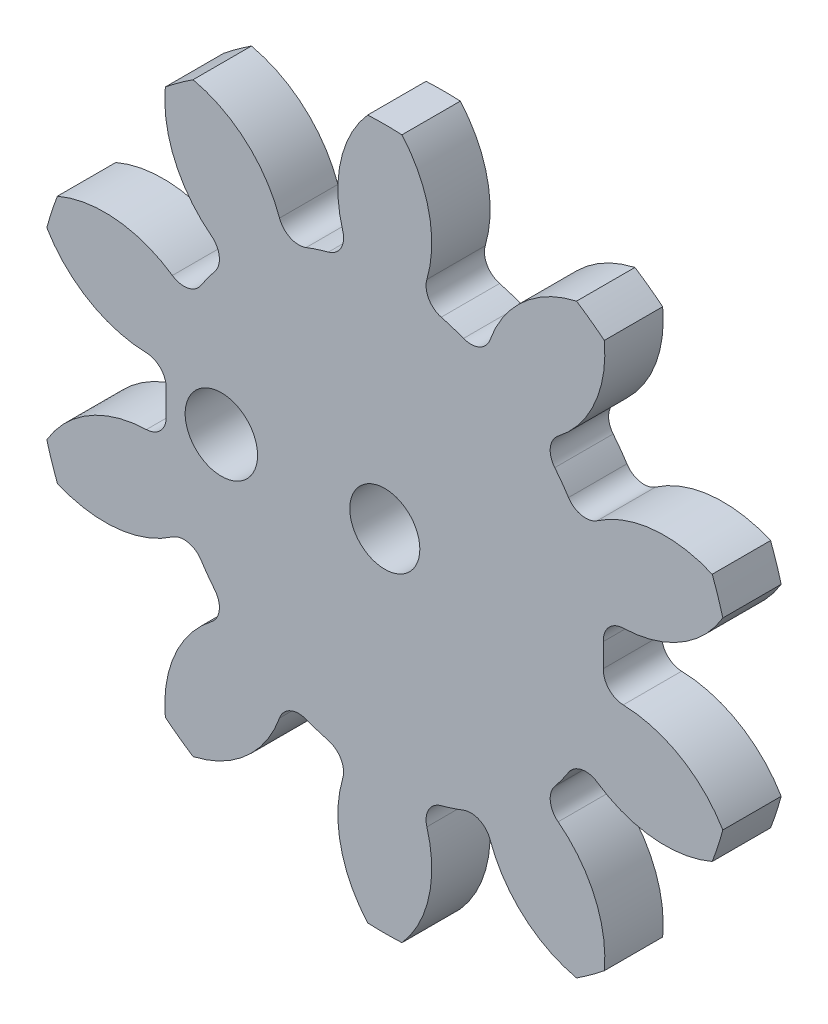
ISO-10303-21;
HEADER;
FILE_DESCRIPTION(('STEP AP214'),'2;1');
FILE_NAME('part.step','',(''),(''),'','','');
FILE_SCHEMA(('AUTOMOTIVE_DESIGN { 1 0 10303 214 1 1 1 1 }'));
ENDSEC;
DATA;
#1=APPLICATION_CONTEXT('core data for automotive mechanical design processes');
#2=APPLICATION_PROTOCOL_DEFINITION('international standard','automotive_design',2000,#1);
#3=PRODUCT_CONTEXT('',#1,'mechanical');
#4=PRODUCT('Part','Part','',(#3));
#5=PRODUCT_RELATED_PRODUCT_CATEGORY('part','',(#4));
#6=PRODUCT_DEFINITION_FORMATION('','',#4);
#7=PRODUCT_DEFINITION_CONTEXT('part definition',#1,'design');
#8=PRODUCT_DEFINITION('design','',#6,#7);
#9=PRODUCT_DEFINITION_SHAPE('','',#8);
#10=(LENGTH_UNIT() NAMED_UNIT(*) SI_UNIT(.MILLI.,.METRE.));
#11=(NAMED_UNIT(*) PLANE_ANGLE_UNIT() SI_UNIT($,.RADIAN.));
#12=(NAMED_UNIT(*) SI_UNIT($,.STERADIAN.) SOLID_ANGLE_UNIT());
#13=UNCERTAINTY_MEASURE_WITH_UNIT(LENGTH_MEASURE(1.E-05),#10,'distance_accuracy_value','');
#14=(GEOMETRIC_REPRESENTATION_CONTEXT(3) GLOBAL_UNCERTAINTY_ASSIGNED_CONTEXT((#13)) GLOBAL_UNIT_ASSIGNED_CONTEXT((#10,
#11,#12)) REPRESENTATION_CONTEXT('',''));
#15=CARTESIAN_POINT('',(0.,0.,0.));
#16=DIRECTION('',(0.,0.,1.));
#17=DIRECTION('',(1.,0.,0.));
#18=AXIS2_PLACEMENT_3D('',#15,#16,#17);
#19=CARTESIAN_POINT('',(0.,0.,5.));
#20=DIRECTION('',(0.,0.,-1.));
#21=DIRECTION('',(-1.,0.,0.));
#22=AXIS2_PLACEMENT_3D('',#19,#20,#21);
#23=CYLINDRICAL_SURFACE('',#22,18.75);
#24=CARTESIAN_POINT('',(0.,0.,5.));
#25=DIRECTION('',(0.,0.,1.));
#26=DIRECTION('',(1.,0.,0.));
#27=AXIS2_PLACEMENT_3D('',#24,#25,#26);
#28=CIRCLE('',#27,18.75);
#29=CARTESIAN_POINT('',(6.74042417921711,17.4965477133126,5.));
#30=VERTEX_POINT('',#29);
#31=CARTESIAN_POINT('',(4.83109500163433,18.1169263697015,5.));
#32=VERTEX_POINT('',#31);
#33=EDGE_CURVE('E650',#30,#32,#28,.T.);
#34=ORIENTED_EDGE('',*,*,#33,.F.);
#35=DIRECTION('',(0.,0.,-1.));
#36=VECTOR('',#35,1.);
#37=CARTESIAN_POINT('',(6.74042417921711,17.4965477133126,5.));
#38=LINE('',#37,#36);
#39=CARTESIAN_POINT('',(6.74042417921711,17.4965477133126,0.));
#40=VERTEX_POINT('',#39);
#41=EDGE_CURVE('E694',#30,#40,#38,.T.);
#42=ORIENTED_EDGE('',*,*,#41,.T.);
#43=CARTESIAN_POINT('',(0.,0.,0.));
#44=DIRECTION('',(0.,0.,1.));
#45=DIRECTION('',(1.,0.,0.));
#46=AXIS2_PLACEMENT_3D('',#43,#44,#45);
#47=CIRCLE('',#46,18.75);
#48=CARTESIAN_POINT('',(4.83109500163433,18.1169263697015,0.));
#49=VERTEX_POINT('',#48);
#50=EDGE_CURVE('E638',#40,#49,#47,.T.);
#51=ORIENTED_EDGE('',*,*,#50,.T.);
#52=DIRECTION('',(0.,0.,-1.));
#53=VECTOR('',#52,1.);
#54=CARTESIAN_POINT('',(4.83109500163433,18.1169263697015,5.));
#55=LINE('',#54,#53);
#56=EDGE_CURVE('E670',#49,#32,#55,.F.);
#57=ORIENTED_EDGE('',*,*,#56,.T.);
#58=EDGE_LOOP('',(#34,#42,#51,#57));
#59=FACE_BOUND('',#58,.T.);
#60=ADVANCED_FACE('F26',(#59),#23,.T.);
#61=CARTESIAN_POINT('',(-6.22828729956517,23.1968293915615,5.));
#62=DIRECTION('',(0.,0.,-1.));
#63=DIRECTION('',(-1.,0.,0.));
#64=AXIS2_PLACEMENT_3D('',#61,#62,#63);
#65=CYLINDRICAL_SURFACE('',#64,10.2488291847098);
#66=CARTESIAN_POINT('',(-6.22828729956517,23.1968293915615,5.));
#67=DIRECTION('',(0.,0.,-1.));
#68=DIRECTION('',(-1.,0.,0.));
#69=AXIS2_PLACEMENT_3D('',#66,#67,#68);
#70=CIRCLE('',#69,10.2488291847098);
#71=CARTESIAN_POINT('',(1.46869465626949,29.9640273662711,5.));
#72=VERTEX_POINT('',#71);
#73=CARTESIAN_POINT('',(3.60325025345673,20.3021154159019,5.));
#74=VERTEX_POINT('',#73);
#75=EDGE_CURVE('E652',#72,#74,#70,.T.);
#76=ORIENTED_EDGE('',*,*,#75,.T.);
#77=DIRECTION('',(0.,0.,-1.));
#78=VECTOR('',#77,1.);
#79=CARTESIAN_POINT('',(3.60325025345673,20.3021154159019,5.));
#80=LINE('',#79,#78);
#81=CARTESIAN_POINT('',(3.60325025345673,20.3021154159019,0.));
#82=VERTEX_POINT('',#81);
#83=EDGE_CURVE('E667',#74,#82,#80,.T.);
#84=ORIENTED_EDGE('',*,*,#83,.T.);
#85=CARTESIAN_POINT('',(-6.22828729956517,23.1968293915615,0.));
#86=DIRECTION('',(0.,0.,-1.));
#87=DIRECTION('',(-1.,0.,0.));
#88=AXIS2_PLACEMENT_3D('',#85,#86,#87);
#89=CIRCLE('',#88,10.2488291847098);
#90=CARTESIAN_POINT('',(1.46869465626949,29.9640273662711,0.));
#91=VERTEX_POINT('',#90);
#92=EDGE_CURVE('E640',#91,#82,#89,.T.);
#93=ORIENTED_EDGE('',*,*,#92,.F.);
#94=DIRECTION('',(0.,0.,-1.));
#95=VECTOR('',#94,1.);
#96=CARTESIAN_POINT('',(1.46869465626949,29.9640273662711,5.));
#97=LINE('',#96,#95);
#98=EDGE_CURVE('E665',#72,#91,#97,.T.);
#99=ORIENTED_EDGE('',*,*,#98,.F.);
#100=EDGE_LOOP('',(#76,#84,#93,#99));
#101=FACE_BOUND('',#100,.T.);
#102=ADVANCED_FACE('F887',(#101),#65,.T.);
#103=CARTESIAN_POINT('',(0.,0.,5.));
#104=DIRECTION('',(0.,0.,-1.));
#105=DIRECTION('',(-1.,0.,0.));
#106=AXIS2_PLACEMENT_3D('',#103,#104,#105);
#107=CYLINDRICAL_SURFACE('',#106,30.);
#108=CARTESIAN_POINT('',(0.,0.,0.));
#109=DIRECTION('',(0.,0.,1.));
#110=DIRECTION('',(1.,0.,0.));
#111=AXIS2_PLACEMENT_3D('',#108,#109,#110);
#112=CIRCLE('',#111,30.);
#113=CARTESIAN_POINT('',(-1.46869465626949,29.9640273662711,0.));
#114=VERTEX_POINT('',#113);
#115=EDGE_CURVE('E643',#91,#114,#112,.T.);
#116=ORIENTED_EDGE('',*,*,#115,.T.);
#117=DIRECTION('',(0.,0.,-1.));
#118=VECTOR('',#117,1.);
#119=CARTESIAN_POINT('',(-1.46869465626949,29.9640273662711,5.));
#120=LINE('',#119,#118);
#121=CARTESIAN_POINT('',(-1.46869465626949,29.9640273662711,5.));
#122=VERTEX_POINT('',#121);
#123=EDGE_CURVE('E662',#122,#114,#120,.T.);
#124=ORIENTED_EDGE('',*,*,#123,.F.);
#125=CARTESIAN_POINT('',(0.,0.,5.));
#126=DIRECTION('',(0.,0.,1.));
#127=DIRECTION('',(1.,0.,0.));
#128=AXIS2_PLACEMENT_3D('',#125,#126,#127);
#129=CIRCLE('',#128,30.);
#130=EDGE_CURVE('E655',#72,#122,#129,.T.);
#131=ORIENTED_EDGE('',*,*,#130,.F.);
#132=ORIENTED_EDGE('',*,*,#98,.T.);
#133=EDGE_LOOP('',(#116,#124,#131,#132));
#134=FACE_BOUND('',#133,.T.);
#135=ADVANCED_FACE('F883',(#134),#107,.T.);
#136=CARTESIAN_POINT('',(6.22828729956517,23.1968293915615,5.));
#137=DIRECTION('',(0.,0.,-1.));
#138=DIRECTION('',(-1.,0.,0.));
#139=AXIS2_PLACEMENT_3D('',#136,#137,#138);
#140=CYLINDRICAL_SURFACE('',#139,10.2488291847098);
#141=CARTESIAN_POINT('',(6.22828729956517,23.1968293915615,0.));
#142=DIRECTION('',(0.,0.,1.));
#143=DIRECTION('',(1.,0.,0.));
#144=AXIS2_PLACEMENT_3D('',#141,#142,#143);
#145=CIRCLE('',#144,10.2488291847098);
#146=CARTESIAN_POINT('',(-3.60325025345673,20.3021154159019,0.));
#147=VERTEX_POINT('',#146);
#148=EDGE_CURVE('E645',#114,#147,#145,.T.);
#149=ORIENTED_EDGE('',*,*,#148,.T.);
#150=DIRECTION('',(0.,0.,-1.));
#151=VECTOR('',#150,1.);
#152=CARTESIAN_POINT('',(-3.60325025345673,20.3021154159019,5.));
#153=LINE('',#152,#151);
#154=CARTESIAN_POINT('',(-3.60325025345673,20.3021154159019,5.));
#155=VERTEX_POINT('',#154);
#156=EDGE_CURVE('E676',#147,#155,#153,.F.);
#157=ORIENTED_EDGE('',*,*,#156,.T.);
#158=CARTESIAN_POINT('',(6.22828729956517,23.1968293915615,5.));
#159=DIRECTION('',(0.,0.,1.));
#160=DIRECTION('',(1.,0.,0.));
#161=AXIS2_PLACEMENT_3D('',#158,#159,#160);
#162=CIRCLE('',#161,10.2488291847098);
#163=EDGE_CURVE('E657',#122,#155,#162,.T.);
#164=ORIENTED_EDGE('',*,*,#163,.F.);
#165=ORIENTED_EDGE('',*,*,#123,.T.);
#166=EDGE_LOOP('',(#149,#157,#164,#165));
#167=FACE_BOUND('',#166,.T.);
#168=ADVANCED_FACE('F878',(#167),#140,.T.);
#169=CARTESIAN_POINT('',(0.,0.,5.));
#170=DIRECTION('',(0.,0.,-1.));
#171=DIRECTION('',(-1.,0.,0.));
#172=AXIS2_PLACEMENT_3D('',#169,#170,#171);
#173=CYLINDRICAL_SURFACE('',#172,18.75);
#174=CARTESIAN_POINT('',(0.,0.,0.));
#175=DIRECTION('',(0.,0.,-1.));
#176=DIRECTION('',(-1.,0.,0.));
#177=AXIS2_PLACEMENT_3D('',#174,#175,#176);
#178=CIRCLE('',#177,18.75);
#179=CARTESIAN_POINT('',(-6.74042417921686,17.4965477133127,0.));
#180=VERTEX_POINT('',#179);
#181=CARTESIAN_POINT('',(-4.83109500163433,18.1169263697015,0.));
#182=VERTEX_POINT('',#181);
#183=EDGE_CURVE('E648',#180,#182,#178,.T.);
#184=ORIENTED_EDGE('',*,*,#183,.F.);
#185=DIRECTION('',(0.,0.,-1.));
#186=VECTOR('',#185,1.);
#187=CARTESIAN_POINT('',(-6.74042417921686,17.4965477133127,5.));
#188=LINE('',#187,#186);
#189=CARTESIAN_POINT('',(-6.74042417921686,17.4965477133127,5.));
#190=VERTEX_POINT('',#189);
#191=EDGE_CURVE('E849',#180,#190,#188,.F.);
#192=ORIENTED_EDGE('',*,*,#191,.T.);
#193=CARTESIAN_POINT('',(0.,0.,5.));
#194=DIRECTION('',(0.,0.,-1.));
#195=DIRECTION('',(-1.,0.,0.));
#196=AXIS2_PLACEMENT_3D('',#193,#194,#195);
#197=CIRCLE('',#196,18.75);
#198=CARTESIAN_POINT('',(-4.83109500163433,18.1169263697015,5.));
#199=VERTEX_POINT('',#198);
#200=EDGE_CURVE('E660',#190,#199,#197,.T.);
#201=ORIENTED_EDGE('',*,*,#200,.T.);
#202=DIRECTION('',(0.,0.,-1.));
#203=VECTOR('',#202,1.);
#204=CARTESIAN_POINT('',(-4.83109500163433,18.1169263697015,5.));
#205=LINE('',#204,#203);
#206=EDGE_CURVE('E673',#199,#182,#205,.T.);
#207=ORIENTED_EDGE('',*,*,#206,.T.);
#208=EDGE_LOOP('',(#184,#192,#201,#207));
#209=FACE_BOUND('',#208,.T.);
#210=ADVANCED_FACE('F869',(#209),#173,.T.);
#211=CARTESIAN_POINT('',(0.,0.,5.));
#212=DIRECTION('',(0.,0.,1.));
#213=DIRECTION('',(1.,0.,0.));
#214=AXIS2_PLACEMENT_3D('',#211,#212,#213);
#215=PLANE('',#214);
#216=CARTESIAN_POINT('',(-14.,0.,5.));
#217=DIRECTION('',(0.,0.,1.));
#218=DIRECTION('',(1.,0.,0.));
#219=AXIS2_PLACEMENT_3D('',#216,#217,#218);
#220=CIRCLE('',#219,3.1);
#221=CARTESIAN_POINT('',(-10.9,0.,5.));
#222=VERTEX_POINT('',#221);
#223=EDGE_CURVE('E1593',#222,#222,#220,.T.);
#224=ORIENTED_EDGE('',*,*,#223,.F.);
#225=EDGE_LOOP('',(#224));
#226=FACE_BOUND('',#225,.T.);
#227=CARTESIAN_POINT('',(0.,0.,5.));
#228=DIRECTION('',(0.,0.,1.));
#229=DIRECTION('',(1.,0.,0.));
#230=AXIS2_PLACEMENT_3D('',#227,#228,#229);
#231=CIRCLE('',#230,3.);
#232=CARTESIAN_POINT('',(3.,0.,5.));
#233=VERTEX_POINT('',#232);
#234=EDGE_CURVE('E428',#233,#233,#231,.T.);
#235=ORIENTED_EDGE('',*,*,#234,.F.);
#236=EDGE_LOOP('',(#235));
#237=FACE_BOUND('',#236,.T.);
#238=CARTESIAN_POINT('',(18.6735444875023,15.1057337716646,5.));
#239=DIRECTION('',(0.,0.,1.));
#240=DIRECTION('',(0.809016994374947,-0.587785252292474,0.));
#241=AXIS2_PLACEMENT_3D('',#238,#239,#240);
#242=CIRCLE('',#241,10.2488291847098);
#243=CARTESIAN_POINT('',(16.4242144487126,25.1046844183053,5.));
#244=VERTEX_POINT('',#243);
#245=CARTESIAN_POINT('',(9.01819334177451,18.5426937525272,5.));
#246=VERTEX_POINT('',#245);
#247=EDGE_CURVE('E630',#244,#246,#242,.T.);
#248=ORIENTED_EDGE('',*,*,#247,.T.);
#249=CARTESIAN_POINT('',(7.36953043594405,19.1295588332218,5.));
#250=DIRECTION('',(0.,0.,1.));
#251=DIRECTION('',(1.,0.,0.));
#252=AXIS2_PLACEMENT_3D('',#249,#250,#251);
#253=CIRCLE('',#252,1.75);
#254=EDGE_CURVE('E706',#246,#30,#253,.F.);
#255=ORIENTED_EDGE('',*,*,#254,.T.);
#256=ORIENTED_EDGE('',*,*,#33,.T.);
#257=CARTESIAN_POINT('',(5.28199720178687,19.8078394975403,5.));
#258=DIRECTION('',(0.,0.,1.));
#259=DIRECTION('',(1.,0.,0.));
#260=AXIS2_PLACEMENT_3D('',#257,#258,#259);
#261=CIRCLE('',#260,1.75);
#262=EDGE_CURVE('E681',#32,#74,#261,.F.);
#263=ORIENTED_EDGE('',*,*,#262,.T.);
#264=ORIENTED_EDGE('',*,*,#75,.F.);
#265=ORIENTED_EDGE('',*,*,#130,.T.);
#266=ORIENTED_EDGE('',*,*,#163,.T.);
#267=CARTESIAN_POINT('',(-5.28199720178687,19.8078394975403,5.));
#268=DIRECTION('',(0.,0.,1.));
#269=DIRECTION('',(1.,0.,0.));
#270=AXIS2_PLACEMENT_3D('',#267,#268,#269);
#271=CIRCLE('',#270,1.75);
#272=EDGE_CURVE('E685',#155,#199,#271,.F.);
#273=ORIENTED_EDGE('',*,*,#272,.T.);
#274=ORIENTED_EDGE('',*,*,#200,.F.);
#275=CARTESIAN_POINT('',(-7.36953043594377,19.1295588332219,5.));
#276=DIRECTION('',(0.,0.,1.));
#277=DIRECTION('',(1.,0.,0.));
#278=AXIS2_PLACEMENT_3D('',#275,#276,#277);
#279=CIRCLE('',#278,1.75);
#280=CARTESIAN_POINT('',(-9.01819334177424,18.5426937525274,5.));
#281=VERTEX_POINT('',#280);
#282=EDGE_CURVE('E857',#190,#281,#279,.F.);
#283=ORIENTED_EDGE('',*,*,#282,.T.);
#284=CARTESIAN_POINT('',(-18.6735444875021,15.1057337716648,5.));
#285=DIRECTION('',(0.,0.,-1.));
#286=DIRECTION('',(-0.809016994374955,-0.587785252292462,0.));
#287=AXIS2_PLACEMENT_3D('',#284,#285,#286);
#288=CIRCLE('',#287,10.2488291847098);
#289=CARTESIAN_POINT('',(-16.4242144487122,25.1046844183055,5.));
#290=VERTEX_POINT('',#289);
#291=EDGE_CURVE('E433',#290,#281,#288,.T.);
#292=ORIENTED_EDGE('',*,*,#291,.F.);
#293=CARTESIAN_POINT('',(0.,0.,5.));
#294=DIRECTION('',(0.,0.,1.));
#295=DIRECTION('',(0.809016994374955,0.587785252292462,0.));
#296=AXIS2_PLACEMENT_3D('',#293,#294,#295);
#297=CIRCLE('',#296,30.);
#298=CARTESIAN_POINT('',(-18.8006123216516,23.3781303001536,5.));
#299=VERTEX_POINT('',#298);
#300=EDGE_CURVE('E408',#290,#299,#297,.T.);
#301=ORIENTED_EDGE('',*,*,#300,.T.);
#302=CARTESIAN_POINT('',(-8.59596394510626,22.4275246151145,5.));
#303=DIRECTION('',(0.,0.,1.));
#304=DIRECTION('',(0.809016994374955,0.587785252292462,0.));
#305=AXIS2_PLACEMENT_3D('',#302,#303,#304);
#306=CIRCLE('',#305,10.2488291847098);
#307=CARTESIAN_POINT('',(-14.848374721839,14.3068190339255,5.));
#308=VERTEX_POINT('',#307);
#309=EDGE_CURVE('E436',#299,#308,#306,.T.);
#310=ORIENTED_EDGE('',*,*,#309,.T.);
#311=CARTESIAN_POINT('',(-15.9159814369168,12.9201987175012,5.));
#312=DIRECTION('',(0.,0.,1.));
#313=DIRECTION('',(1.,0.,0.));
#314=AXIS2_PLACEMENT_3D('',#311,#312,#313);
#315=CIRCLE('',#314,1.75);
#316=CARTESIAN_POINT('',(-14.557300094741,11.8172549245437,5.));
#317=VERTEX_POINT('',#316);
#318=EDGE_CURVE('E11',#308,#317,#315,.F.);
#319=ORIENTED_EDGE('',*,*,#318,.T.);
#320=CARTESIAN_POINT('',(0.,0.,5.));
#321=DIRECTION('',(0.,0.,1.));
#322=DIRECTION('',(0.309016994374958,0.95105651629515,0.));
#323=AXIS2_PLACEMENT_3D('',#320,#321,#322);
#324=CIRCLE('',#323,18.75);
#325=CARTESIAN_POINT('',(-15.7373304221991,10.1930825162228,5.));
#326=VERTEX_POINT('',#325);
#327=EDGE_CURVE('E448',#317,#326,#324,.T.);
#328=ORIENTED_EDGE('',*,*,#327,.T.);
#329=CARTESIAN_POINT('',(-17.206147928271,11.1444368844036,5.));
#330=DIRECTION('',(0.,0.,1.));
#331=DIRECTION('',(1.,0.,0.));
#332=AXIS2_PLACEMENT_3D('',#329,#330,#331);
#333=CIRCLE('',#332,1.75);
#334=CARTESIAN_POINT('',(-18.1949935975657,9.70059331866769,5.));
#335=VERTEX_POINT('',#334);
#336=EDGE_CURVE('E842',#326,#335,#333,.F.);
#337=ORIENTED_EDGE('',*,*,#336,.T.);
#338=CARTESIAN_POINT('',(-23.9861423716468,1.24476127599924,5.));
#339=DIRECTION('',(0.,0.,-1.));
#340=DIRECTION('',(-0.309016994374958,-0.95105651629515,0.));
#341=AXIS2_PLACEMENT_3D('',#338,#339,#340);
#342=CIRCLE('',#341,10.2488291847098);
#343=CARTESIAN_POINT('',(-28.0436318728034,10.6562052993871,5.));
#344=VERTEX_POINT('',#343);
#345=EDGE_CURVE('E450',#344,#335,#342,.T.);
#346=ORIENTED_EDGE('',*,*,#345,.F.);
#347=CARTESIAN_POINT('',(0.,0.,5.));
#348=DIRECTION('',(0.,0.,1.));
#349=DIRECTION('',(0.309016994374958,0.95105651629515,0.));
#350=AXIS2_PLACEMENT_3D('',#347,#348,#349);
#351=CIRCLE('',#350,30.);
#352=CARTESIAN_POINT('',(-28.9513350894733,7.86258205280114,5.));
#353=VERTEX_POINT('',#352);
#354=EDGE_CURVE('E453',#344,#353,#351,.T.);
#355=ORIENTED_EDGE('',*,*,#354,.T.);
#356=CARTESIAN_POINT('',(-20.1368491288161,13.0916677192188,5.));
#357=DIRECTION('',(0.,0.,1.));
#358=DIRECTION('',(0.309016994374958,0.95105651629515,0.));
#359=AXIS2_PLACEMENT_3D('',#356,#357,#358);
#360=CIRCLE('',#359,10.2488291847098);
#361=CARTESIAN_POINT('',(-20.4219247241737,2.84680405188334,5.));
#362=VERTEX_POINT('',#361);
#363=EDGE_CURVE('E455',#353,#362,#360,.T.);
#364=ORIENTED_EDGE('',*,*,#363,.T.);
#365=CARTESIAN_POINT('',(-20.4706017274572,1.09748116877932,5.));
#366=DIRECTION('',(0.,0.,1.));
#367=DIRECTION('',(1.,0.,0.));
#368=AXIS2_PLACEMENT_3D('',#365,#366,#367);
#369=CIRCLE('',#368,1.75);
#370=CARTESIAN_POINT('',(-18.7231113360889,1.00379375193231,5.));
#371=VERTEX_POINT('',#370);
#372=EDGE_CURVE('E846',#362,#371,#369,.F.);
#373=ORIENTED_EDGE('',*,*,#372,.T.);
#374=CARTESIAN_POINT('',(0.,0.,5.));
#375=DIRECTION('',(0.,0.,1.));
#376=DIRECTION('',(-0.309016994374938,0.951056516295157,0.));
#377=AXIS2_PLACEMENT_3D('',#374,#375,#376);
#378=CIRCLE('',#377,18.75);
#379=CARTESIAN_POINT('',(-18.7231113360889,-1.00379375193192,5.));
#380=VERTEX_POINT('',#379);
#381=EDGE_CURVE('E473',#371,#380,#378,.T.);
#382=ORIENTED_EDGE('',*,*,#381,.T.);
#383=CARTESIAN_POINT('',(-20.4706017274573,-1.0974811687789,5.));
#384=DIRECTION('',(0.,0.,1.));
#385=DIRECTION('',(1.,0.,0.));
#386=AXIS2_PLACEMENT_3D('',#383,#384,#385);
#387=CIRCLE('',#386,1.75);
#388=CARTESIAN_POINT('',(-20.4219247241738,-2.84680405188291,5.));
#389=VERTEX_POINT('',#388);
#390=EDGE_CURVE('E822',#380,#389,#387,.F.);
#391=ORIENTED_EDGE('',*,*,#390,.T.);
#392=CARTESIAN_POINT('',(-20.1368491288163,-13.0916677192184,5.));
#393=DIRECTION('',(0.,0.,-1.));
#394=DIRECTION('',(0.309016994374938,-0.951056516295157,0.));
#395=AXIS2_PLACEMENT_3D('',#392,#393,#394);
#396=CIRCLE('',#395,10.2488291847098);
#397=CARTESIAN_POINT('',(-28.9513350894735,-7.86258205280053,5.));
#398=VERTEX_POINT('',#397);
#399=EDGE_CURVE('E475',#398,#389,#396,.T.);
#400=ORIENTED_EDGE('',*,*,#399,.F.);
#401=CARTESIAN_POINT('',(0.,0.,5.));
#402=DIRECTION('',(0.,0.,1.));
#403=DIRECTION('',(-0.309016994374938,0.951056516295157,0.));
#404=AXIS2_PLACEMENT_3D('',#401,#402,#403);
#405=CIRCLE('',#404,30.);
#406=CARTESIAN_POINT('',(-28.0436318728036,-10.6562052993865,5.));
#407=VERTEX_POINT('',#406);
#408=EDGE_CURVE('E478',#398,#407,#405,.T.);
#409=ORIENTED_EDGE('',*,*,#408,.T.);
#410=CARTESIAN_POINT('',(-23.9861423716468,-1.24476127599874,5.));
#411=DIRECTION('',(0.,0.,1.));
#412=DIRECTION('',(-0.309016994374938,0.951056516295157,0.));
#413=AXIS2_PLACEMENT_3D('',#410,#411,#412);
#414=CIRCLE('',#413,10.2488291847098);
#415=CARTESIAN_POINT('',(-18.1949935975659,-9.70059331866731,5.));
#416=VERTEX_POINT('',#415);
#417=EDGE_CURVE('E480',#407,#416,#414,.T.);
#418=ORIENTED_EDGE('',*,*,#417,.T.);
#419=CARTESIAN_POINT('',(-17.2061479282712,-11.1444368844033,5.));
#420=DIRECTION('',(0.,0.,1.));
#421=DIRECTION('',(1.,0.,0.));
#422=AXIS2_PLACEMENT_3D('',#419,#420,#421);
#423=CIRCLE('',#422,1.75);
#424=CARTESIAN_POINT('',(-15.7373304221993,-10.1930825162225,5.));
#425=VERTEX_POINT('',#424);
#426=EDGE_CURVE('E826',#416,#425,#423,.F.);
#427=ORIENTED_EDGE('',*,*,#426,.T.);
#428=CARTESIAN_POINT('',(0.,0.,5.));
#429=DIRECTION('',(0.,0.,1.));
#430=DIRECTION('',(-0.809016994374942,0.58778525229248,0.));
#431=AXIS2_PLACEMENT_3D('',#428,#429,#430);
#432=CIRCLE('',#431,18.75);
#433=CARTESIAN_POINT('',(-14.5573000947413,-11.8172549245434,5.));
#434=VERTEX_POINT('',#433);
#435=EDGE_CURVE('E498',#425,#434,#432,.T.);
#436=ORIENTED_EDGE('',*,*,#435,.T.);
#437=CARTESIAN_POINT('',(-15.9159814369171,-12.9201987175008,5.));
#438=DIRECTION('',(0.,0.,1.));
#439=DIRECTION('',(1.,0.,0.));
#440=AXIS2_PLACEMENT_3D('',#437,#438,#439);
#441=CIRCLE('',#440,1.75);
#442=CARTESIAN_POINT('',(-14.8483747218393,-14.3068190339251,5.));
#443=VERTEX_POINT('',#442);
#444=EDGE_CURVE('E802',#434,#443,#441,.F.);
#445=ORIENTED_EDGE('',*,*,#444,.T.);
#446=CARTESIAN_POINT('',(-8.59596394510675,-22.4275246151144,5.));
#447=DIRECTION('',(0.,0.,-1.));
#448=DIRECTION('',(0.809016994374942,-0.58778525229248,0.));
#449=AXIS2_PLACEMENT_3D('',#446,#447,#448);
#450=CIRCLE('',#449,10.2488291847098);
#451=CARTESIAN_POINT('',(-18.8006123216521,-23.3781303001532,5.));
#452=VERTEX_POINT('',#451);
#453=EDGE_CURVE('E500',#452,#443,#450,.T.);
#454=ORIENTED_EDGE('',*,*,#453,.F.);
#455=CARTESIAN_POINT('',(0.,0.,5.));
#456=DIRECTION('',(0.,0.,1.));
#457=DIRECTION('',(-0.809016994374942,0.58778525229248,0.));
#458=AXIS2_PLACEMENT_3D('',#455,#456,#457);
#459=CIRCLE('',#458,30.);
#460=CARTESIAN_POINT('',(-16.4242144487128,-25.1046844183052,5.));
#461=VERTEX_POINT('',#460);
#462=EDGE_CURVE('E503',#452,#461,#459,.T.);
#463=ORIENTED_EDGE('',*,*,#462,.T.);
#464=CARTESIAN_POINT('',(-18.6735444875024,-15.1057337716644,5.));
#465=DIRECTION('',(0.,0.,1.));
#466=DIRECTION('',(-0.809016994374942,0.58778525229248,0.));
#467=AXIS2_PLACEMENT_3D('',#464,#465,#466);
#468=CIRCLE('',#467,10.2488291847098);
#469=CARTESIAN_POINT('',(-9.01819334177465,-18.5426937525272,5.));
#470=VERTEX_POINT('',#469);
#471=EDGE_CURVE('E505',#461,#470,#468,.T.);
#472=ORIENTED_EDGE('',*,*,#471,.T.);
#473=CARTESIAN_POINT('',(-7.36953043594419,-19.1295588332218,5.));
#474=DIRECTION('',(0.,0.,1.));
#475=DIRECTION('',(1.,0.,0.));
#476=AXIS2_PLACEMENT_3D('',#473,#474,#475);
#477=CIRCLE('',#476,1.75);
#478=CARTESIAN_POINT('',(-6.74042417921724,-17.4965477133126,5.));
#479=VERTEX_POINT('',#478);
#480=EDGE_CURVE('E806',#470,#479,#477,.F.);
#481=ORIENTED_EDGE('',*,*,#480,.T.);
#482=CARTESIAN_POINT('',(0.,0.,5.));
#483=DIRECTION('',(0.,0.,1.));
#484=DIRECTION('',(-1.,0.,0.));
#485=AXIS2_PLACEMENT_3D('',#482,#483,#484);
#486=CIRCLE('',#485,18.75);
#487=CARTESIAN_POINT('',(-4.83109500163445,-18.1169263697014,5.));
#488=VERTEX_POINT('',#487);
#489=EDGE_CURVE('E523',#479,#488,#486,.T.);
#490=ORIENTED_EDGE('',*,*,#489,.T.);
#491=CARTESIAN_POINT('',(-5.281997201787,-19.8078394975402,5.));
#492=DIRECTION('',(0.,0.,1.));
#493=DIRECTION('',(1.,0.,0.));
#494=AXIS2_PLACEMENT_3D('',#491,#492,#493);
#495=CIRCLE('',#494,1.75);
#496=CARTESIAN_POINT('',(-3.60325025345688,-20.3021154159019,5.));
#497=VERTEX_POINT('',#496);
#498=EDGE_CURVE('E782',#488,#497,#495,.F.);
#499=ORIENTED_EDGE('',*,*,#498,.T.);
#500=CARTESIAN_POINT('',(6.22828729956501,-23.1968293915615,5.));
#501=DIRECTION('',(0.,0.,-1.));
#502=DIRECTION('',(1.,0.,0.));
#503=AXIS2_PLACEMENT_3D('',#500,#501,#502);
#504=CIRCLE('',#503,10.2488291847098);
#505=CARTESIAN_POINT('',(-1.4686946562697,-29.9640273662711,5.));
#506=VERTEX_POINT('',#505);
#507=EDGE_CURVE('E525',#506,#497,#504,.T.);
#508=ORIENTED_EDGE('',*,*,#507,.F.);
#509=CARTESIAN_POINT('',(0.,0.,5.));
#510=DIRECTION('',(0.,0.,1.));
#511=DIRECTION('',(-1.,0.,0.));
#512=AXIS2_PLACEMENT_3D('',#509,#510,#511);
#513=CIRCLE('',#512,30.);
#514=CARTESIAN_POINT('',(1.46869465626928,-29.9640273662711,5.));
#515=VERTEX_POINT('',#514);
#516=EDGE_CURVE('E528',#506,#515,#513,.T.);
#517=ORIENTED_EDGE('',*,*,#516,.T.);
#518=CARTESIAN_POINT('',(-6.22828729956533,-23.1968293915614,5.));
#519=DIRECTION('',(0.,0.,1.));
#520=DIRECTION('',(-1.,0.,0.));
#521=AXIS2_PLACEMENT_3D('',#518,#519,#520);
#522=CIRCLE('',#521,10.2488291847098);
#523=CARTESIAN_POINT('',(3.60325025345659,-20.3021154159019,5.));
#524=VERTEX_POINT('',#523);
#525=EDGE_CURVE('E530',#515,#524,#522,.T.);
#526=ORIENTED_EDGE('',*,*,#525,.T.);
#527=CARTESIAN_POINT('',(5.28199720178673,-19.8078394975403,5.));
#528=DIRECTION('',(0.,0.,1.));
#529=DIRECTION('',(1.,0.,0.));
#530=AXIS2_PLACEMENT_3D('',#527,#528,#529);
#531=CIRCLE('',#530,1.75);
#532=CARTESIAN_POINT('',(4.8310950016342,-18.1169263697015,5.));
#533=VERTEX_POINT('',#532);
#534=EDGE_CURVE('E786',#524,#533,#531,.F.);
#535=ORIENTED_EDGE('',*,*,#534,.T.);
#536=CARTESIAN_POINT('',(0.,0.,5.));
#537=DIRECTION('',(0.,0.,1.));
#538=DIRECTION('',(-0.809016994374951,-0.587785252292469,0.));
#539=AXIS2_PLACEMENT_3D('',#536,#537,#538);
#540=CIRCLE('',#539,18.75);
#541=CARTESIAN_POINT('',(6.74042417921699,-17.4965477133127,5.));
#542=VERTEX_POINT('',#541);
#543=EDGE_CURVE('E548',#533,#542,#540,.T.);
#544=ORIENTED_EDGE('',*,*,#543,.T.);
#545=CARTESIAN_POINT('',(7.36953043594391,-19.1295588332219,5.));
#546=DIRECTION('',(0.,0.,1.));
#547=DIRECTION('',(1.,0.,0.));
#548=AXIS2_PLACEMENT_3D('',#545,#546,#547);
#549=CIRCLE('',#548,1.75);
#550=CARTESIAN_POINT('',(9.01819334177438,-18.5426937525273,5.));
#551=VERTEX_POINT('',#550);
#552=EDGE_CURVE('E762',#542,#551,#549,.F.);
#553=ORIENTED_EDGE('',*,*,#552,.T.);
#554=CARTESIAN_POINT('',(18.6735444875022,-15.1057337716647,5.));
#555=DIRECTION('',(0.,0.,-1.));
#556=DIRECTION('',(0.809016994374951,0.587785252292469,0.));
#557=AXIS2_PLACEMENT_3D('',#554,#555,#556);
#558=CIRCLE('',#557,10.2488291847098);
#559=CARTESIAN_POINT('',(16.4242144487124,-25.1046844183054,5.));
#560=VERTEX_POINT('',#559);
#561=EDGE_CURVE('E550',#560,#551,#558,.T.);
#562=ORIENTED_EDGE('',*,*,#561,.F.);
#563=CARTESIAN_POINT('',(0.,0.,5.));
#564=DIRECTION('',(0.,0.,1.));
#565=DIRECTION('',(-0.809016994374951,-0.587785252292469,0.));
#566=AXIS2_PLACEMENT_3D('',#563,#564,#565);
#567=CIRCLE('',#566,30.);
#568=CARTESIAN_POINT('',(18.8006123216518,-23.3781303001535,5.));
#569=VERTEX_POINT('',#568);
#570=EDGE_CURVE('E553',#560,#569,#567,.T.);
#571=ORIENTED_EDGE('',*,*,#570,.T.);
#572=CARTESIAN_POINT('',(8.59596394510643,-22.4275246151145,5.));
#573=DIRECTION('',(0.,0.,1.));
#574=DIRECTION('',(-0.809016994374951,-0.587785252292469,0.));
#575=AXIS2_PLACEMENT_3D('',#572,#573,#574);
#576=CIRCLE('',#575,10.2488291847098);
#577=CARTESIAN_POINT('',(14.8483747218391,-14.3068190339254,5.));
#578=VERTEX_POINT('',#577);
#579=EDGE_CURVE('E555',#569,#578,#576,.T.);
#580=ORIENTED_EDGE('',*,*,#579,.T.);
#581=CARTESIAN_POINT('',(15.9159814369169,-12.920198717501,5.));
#582=DIRECTION('',(0.,0.,1.));
#583=DIRECTION('',(1.,0.,0.));
#584=AXIS2_PLACEMENT_3D('',#581,#582,#583);
#585=CIRCLE('',#584,1.75);
#586=CARTESIAN_POINT('',(14.5573000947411,-11.8172549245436,5.));
#587=VERTEX_POINT('',#586);
#588=EDGE_CURVE('E766',#578,#587,#585,.F.);
#589=ORIENTED_EDGE('',*,*,#588,.T.);
#590=CARTESIAN_POINT('',(0.,0.,5.));
#591=DIRECTION('',(0.,0.,1.));
#592=DIRECTION('',(-0.309016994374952,-0.951056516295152,0.));
#593=AXIS2_PLACEMENT_3D('',#590,#591,#592);
#594=CIRCLE('',#593,18.75);
#595=CARTESIAN_POINT('',(15.7373304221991,-10.1930825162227,5.));
#596=VERTEX_POINT('',#595);
#597=EDGE_CURVE('E573',#587,#596,#594,.T.);
#598=ORIENTED_EDGE('',*,*,#597,.T.);
#599=CARTESIAN_POINT('',(17.2061479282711,-11.1444368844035,5.));
#600=DIRECTION('',(0.,0.,1.));
#601=DIRECTION('',(1.,0.,0.));
#602=AXIS2_PLACEMENT_3D('',#599,#600,#601);
#603=CIRCLE('',#602,1.75);
#604=CARTESIAN_POINT('',(18.1949935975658,-9.70059331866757,5.));
#605=VERTEX_POINT('',#604);
#606=EDGE_CURVE('E742',#596,#605,#603,.F.);
#607=ORIENTED_EDGE('',*,*,#606,.T.);
#608=CARTESIAN_POINT('',(23.9861423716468,-1.24476127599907,5.));
#609=DIRECTION('',(0.,0.,-1.));
#610=DIRECTION('',(0.309016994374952,0.951056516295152,0.));
#611=AXIS2_PLACEMENT_3D('',#608,#609,#610);
#612=CIRCLE('',#611,10.2488291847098);
#613=CARTESIAN_POINT('',(28.0436318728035,-10.6562052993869,5.));
#614=VERTEX_POINT('',#613);
#615=EDGE_CURVE('E575',#614,#605,#612,.T.);
#616=ORIENTED_EDGE('',*,*,#615,.F.);
#617=CARTESIAN_POINT('',(0.,0.,5.));
#618=DIRECTION('',(0.,0.,1.));
#619=DIRECTION('',(-0.309016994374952,-0.951056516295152,0.));
#620=AXIS2_PLACEMENT_3D('',#617,#618,#619);
#621=CIRCLE('',#620,30.);
#622=CARTESIAN_POINT('',(28.9513350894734,-7.86258205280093,5.));
#623=VERTEX_POINT('',#622);
#624=EDGE_CURVE('E578',#614,#623,#621,.T.);
#625=ORIENTED_EDGE('',*,*,#624,.T.);
#626=CARTESIAN_POINT('',(20.1368491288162,-13.0916677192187,5.));
#627=DIRECTION('',(0.,0.,1.));
#628=DIRECTION('',(-0.309016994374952,-0.951056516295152,0.));
#629=AXIS2_PLACEMENT_3D('',#626,#627,#628);
#630=CIRCLE('',#629,10.2488291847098);
#631=CARTESIAN_POINT('',(20.4219247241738,-2.84680405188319,5.));
#632=VERTEX_POINT('',#631);
#633=EDGE_CURVE('E580',#623,#632,#630,.T.);
#634=ORIENTED_EDGE('',*,*,#633,.T.);
#635=CARTESIAN_POINT('',(20.4706017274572,-1.09748116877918,5.));
#636=DIRECTION('',(0.,0.,1.));
#637=DIRECTION('',(1.,0.,0.));
#638=AXIS2_PLACEMENT_3D('',#635,#636,#637);
#639=CIRCLE('',#638,1.75);
#640=CARTESIAN_POINT('',(18.7231113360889,-1.00379375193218,5.));
#641=VERTEX_POINT('',#640);
#642=EDGE_CURVE('E746',#632,#641,#639,.F.);
#643=ORIENTED_EDGE('',*,*,#642,.T.);
#644=CARTESIAN_POINT('',(0.,0.,5.));
#645=DIRECTION('',(0.,0.,1.));
#646=DIRECTION('',(0.309016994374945,-0.951056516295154,0.));
#647=AXIS2_PLACEMENT_3D('',#644,#645,#646);
#648=CIRCLE('',#647,18.75);
#649=CARTESIAN_POINT('',(18.7231113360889,1.00379375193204,5.));
#650=VERTEX_POINT('',#649);
#651=EDGE_CURVE('E598',#641,#650,#648,.T.);
#652=ORIENTED_EDGE('',*,*,#651,.T.);
#653=CARTESIAN_POINT('',(20.4706017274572,1.09748116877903,5.));
#654=DIRECTION('',(0.,0.,1.));
#655=DIRECTION('',(1.,0.,0.));
#656=AXIS2_PLACEMENT_3D('',#653,#654,#655);
#657=CIRCLE('',#656,1.75);
#658=CARTESIAN_POINT('',(20.4219247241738,2.84680405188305,5.));
#659=VERTEX_POINT('',#658);
#660=EDGE_CURVE('E722',#650,#659,#657,.F.);
#661=ORIENTED_EDGE('',*,*,#660,.T.);
#662=CARTESIAN_POINT('',(20.1368491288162,13.0916677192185,5.));
#663=DIRECTION('',(0.,0.,-1.));
#664=DIRECTION('',(-0.309016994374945,0.951056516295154,0.));
#665=AXIS2_PLACEMENT_3D('',#662,#663,#664);
#666=CIRCLE('',#665,10.2488291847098);
#667=CARTESIAN_POINT('',(28.9513350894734,7.86258205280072,5.));
#668=VERTEX_POINT('',#667);
#669=EDGE_CURVE('E600',#668,#659,#666,.T.);
#670=ORIENTED_EDGE('',*,*,#669,.F.);
#671=CARTESIAN_POINT('',(0.,0.,5.));
#672=DIRECTION('',(0.,0.,1.));
#673=DIRECTION('',(0.309016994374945,-0.951056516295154,0.));
#674=AXIS2_PLACEMENT_3D('',#671,#672,#673);
#675=CIRCLE('',#674,30.);
#676=CARTESIAN_POINT('',(28.0436318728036,10.6562052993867,5.));
#677=VERTEX_POINT('',#676);
#678=EDGE_CURVE('E603',#668,#677,#675,.T.);
#679=ORIENTED_EDGE('',*,*,#678,.T.);
#680=CARTESIAN_POINT('',(23.9861423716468,1.2447612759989,5.));
#681=DIRECTION('',(0.,0.,1.));
#682=DIRECTION('',(0.309016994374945,-0.951056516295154,0.));
#683=AXIS2_PLACEMENT_3D('',#680,#681,#682);
#684=CIRCLE('',#683,10.2488291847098);
#685=CARTESIAN_POINT('',(18.1949935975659,9.70059331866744,5.));
#686=VERTEX_POINT('',#685);
#687=EDGE_CURVE('E605',#677,#686,#684,.T.);
#688=ORIENTED_EDGE('',*,*,#687,.T.);
#689=CARTESIAN_POINT('',(17.2061479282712,11.1444368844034,5.));
#690=DIRECTION('',(0.,0.,1.));
#691=DIRECTION('',(1.,0.,0.));
#692=AXIS2_PLACEMENT_3D('',#689,#690,#691);
#693=CIRCLE('',#692,1.75);
#694=CARTESIAN_POINT('',(15.7373304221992,10.1930825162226,5.));
#695=VERTEX_POINT('',#694);
#696=EDGE_CURVE('E726',#686,#695,#693,.F.);
#697=ORIENTED_EDGE('',*,*,#696,.T.);
#698=CARTESIAN_POINT('',(0.,0.,5.));
#699=DIRECTION('',(0.,0.,1.));
#700=DIRECTION('',(0.809016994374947,-0.587785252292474,0.));
#701=AXIS2_PLACEMENT_3D('',#698,#699,#700);
#702=CIRCLE('',#701,18.75);
#703=CARTESIAN_POINT('',(14.5573000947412,11.8172549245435,5.));
#704=VERTEX_POINT('',#703);
#705=EDGE_CURVE('E623',#695,#704,#702,.T.);
#706=ORIENTED_EDGE('',*,*,#705,.T.);
#707=CARTESIAN_POINT('',(15.915981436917,12.9201987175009,5.));
#708=DIRECTION('',(0.,0.,1.));
#709=DIRECTION('',(1.,0.,0.));
#710=AXIS2_PLACEMENT_3D('',#707,#708,#709);
#711=CIRCLE('',#710,1.75);
#712=CARTESIAN_POINT('',(14.8483747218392,14.3068190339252,5.));
#713=VERTEX_POINT('',#712);
#714=EDGE_CURVE('E702',#704,#713,#711,.F.);
#715=ORIENTED_EDGE('',*,*,#714,.T.);
#716=CARTESIAN_POINT('',(8.59596394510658,22.4275246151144,5.));
#717=DIRECTION('',(0.,0.,-1.));
#718=DIRECTION('',(-0.809016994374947,0.587785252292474,0.));
#719=AXIS2_PLACEMENT_3D('',#716,#717,#718);
#720=CIRCLE('',#719,10.2488291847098);
#721=CARTESIAN_POINT('',(18.800612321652,23.3781303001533,5.));
#722=VERTEX_POINT('',#721);
#723=EDGE_CURVE('E625',#722,#713,#720,.T.);
#724=ORIENTED_EDGE('',*,*,#723,.F.);
#725=CARTESIAN_POINT('',(0.,0.,5.));
#726=DIRECTION('',(0.,0.,1.));
#727=DIRECTION('',(0.809016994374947,-0.587785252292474,0.));
#728=AXIS2_PLACEMENT_3D('',#725,#726,#727);
#729=CIRCLE('',#728,30.);
#730=EDGE_CURVE('E628',#722,#244,#729,.T.);
#731=ORIENTED_EDGE('',*,*,#730,.T.);
#732=EDGE_LOOP('',(#248,#255,#256,#263,#264,#265,#266,#273,#274,#283,#292,#301,#310,#319,#328,
#337,#346,#355,#364,#373,#382,#391,#400,#409,#418,#427,#436,#445,#454,#463,#472,#481,#490,#499,
#508,#517,#526,#535,#544,#553,#562,#571,#580,#589,#598,#607,#616,#625,#634,#643,#652,#661,#670,
#679,#688,#697,#706,#715,#724,#731));
#733=FACE_BOUND('',#732,.T.);
#734=ADVANCED_FACE('F862',(#226,#237,#733),#215,.T.);
#735=CARTESIAN_POINT('',(0.,0.,0.));
#736=DIRECTION('',(0.,0.,1.));
#737=DIRECTION('',(1.,0.,0.));
#738=AXIS2_PLACEMENT_3D('',#735,#736,#737);
#739=PLANE('',#738);
#740=CARTESIAN_POINT('',(-14.,0.,0.));
#741=DIRECTION('',(0.,0.,1.));
#742=DIRECTION('',(1.,0.,0.));
#743=AXIS2_PLACEMENT_3D('',#740,#741,#742);
#744=CIRCLE('',#743,3.1);
#745=CARTESIAN_POINT('',(-10.9,0.,0.));
#746=VERTEX_POINT('',#745);
#747=EDGE_CURVE('E1590',#746,#746,#744,.T.);
#748=ORIENTED_EDGE('',*,*,#747,.T.);
#749=EDGE_LOOP('',(#748));
#750=FACE_BOUND('',#749,.T.);
#751=CARTESIAN_POINT('',(0.,0.,0.));
#752=DIRECTION('',(0.,0.,1.));
#753=DIRECTION('',(1.,0.,0.));
#754=AXIS2_PLACEMENT_3D('',#751,#752,#753);
#755=CIRCLE('',#754,3.);
#756=CARTESIAN_POINT('',(3.,0.,0.));
#757=VERTEX_POINT('',#756);
#758=EDGE_CURVE('E29',#757,#757,#755,.T.);
#759=ORIENTED_EDGE('',*,*,#758,.T.);
#760=EDGE_LOOP('',(#759));
#761=FACE_BOUND('',#760,.T.);
#762=ORIENTED_EDGE('',*,*,#50,.F.);
#763=CARTESIAN_POINT('',(7.36953043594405,19.1295588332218,0.));
#764=DIRECTION('',(0.,0.,1.));
#765=DIRECTION('',(1.,0.,0.));
#766=AXIS2_PLACEMENT_3D('',#763,#764,#765);
#767=CIRCLE('',#766,1.75);
#768=CARTESIAN_POINT('',(9.01819334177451,18.5426937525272,0.));
#769=VERTEX_POINT('',#768);
#770=EDGE_CURVE('E704',#40,#769,#767,.T.);
#771=ORIENTED_EDGE('',*,*,#770,.T.);
#772=CARTESIAN_POINT('',(18.6735444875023,15.1057337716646,0.));
#773=DIRECTION('',(0.,0.,1.));
#774=DIRECTION('',(0.809016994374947,-0.587785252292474,0.));
#775=AXIS2_PLACEMENT_3D('',#772,#773,#774);
#776=CIRCLE('',#775,10.2488291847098);
#777=CARTESIAN_POINT('',(16.4242144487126,25.1046844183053,0.));
#778=VERTEX_POINT('',#777);
#779=EDGE_CURVE('E620',#778,#769,#776,.T.);
#780=ORIENTED_EDGE('',*,*,#779,.F.);
#781=CARTESIAN_POINT('',(0.,0.,0.));
#782=DIRECTION('',(0.,0.,1.));
#783=DIRECTION('',(0.809016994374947,-0.587785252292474,0.));
#784=AXIS2_PLACEMENT_3D('',#781,#782,#783);
#785=CIRCLE('',#784,30.);
#786=CARTESIAN_POINT('',(18.800612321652,23.3781303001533,0.));
#787=VERTEX_POINT('',#786);
#788=EDGE_CURVE('E618',#787,#778,#785,.T.);
#789=ORIENTED_EDGE('',*,*,#788,.F.);
#790=CARTESIAN_POINT('',(8.59596394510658,22.4275246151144,0.));
#791=DIRECTION('',(0.,0.,-1.));
#792=DIRECTION('',(-0.809016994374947,0.587785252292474,0.));
#793=AXIS2_PLACEMENT_3D('',#790,#791,#792);
#794=CIRCLE('',#793,10.2488291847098);
#795=CARTESIAN_POINT('',(14.8483747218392,14.3068190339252,0.));
#796=VERTEX_POINT('',#795);
#797=EDGE_CURVE('E615',#787,#796,#794,.T.);
#798=ORIENTED_EDGE('',*,*,#797,.T.);
#799=CARTESIAN_POINT('',(15.915981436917,12.9201987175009,0.));
#800=DIRECTION('',(0.,0.,1.));
#801=DIRECTION('',(1.,0.,0.));
#802=AXIS2_PLACEMENT_3D('',#799,#800,#801);
#803=CIRCLE('',#802,1.75);
#804=CARTESIAN_POINT('',(14.5573000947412,11.8172549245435,0.));
#805=VERTEX_POINT('',#804);
#806=EDGE_CURVE('E699',#796,#805,#803,.T.);
#807=ORIENTED_EDGE('',*,*,#806,.T.);
#808=CARTESIAN_POINT('',(0.,0.,0.));
#809=DIRECTION('',(0.,0.,1.));
#810=DIRECTION('',(0.809016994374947,-0.587785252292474,0.));
#811=AXIS2_PLACEMENT_3D('',#808,#809,#810);
#812=CIRCLE('',#811,18.75);
#813=CARTESIAN_POINT('',(15.7373304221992,10.1930825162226,0.));
#814=VERTEX_POINT('',#813);
#815=EDGE_CURVE('E613',#814,#805,#812,.T.);
#816=ORIENTED_EDGE('',*,*,#815,.F.);
#817=CARTESIAN_POINT('',(17.2061479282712,11.1444368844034,0.));
#818=DIRECTION('',(0.,0.,1.));
#819=DIRECTION('',(1.,0.,0.));
#820=AXIS2_PLACEMENT_3D('',#817,#818,#819);
#821=CIRCLE('',#820,1.75);
#822=CARTESIAN_POINT('',(18.1949935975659,9.70059331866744,0.));
#823=VERTEX_POINT('',#822);
#824=EDGE_CURVE('E724',#814,#823,#821,.T.);
#825=ORIENTED_EDGE('',*,*,#824,.T.);
#826=CARTESIAN_POINT('',(23.9861423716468,1.2447612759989,0.));
#827=DIRECTION('',(0.,0.,1.));
#828=DIRECTION('',(0.309016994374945,-0.951056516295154,0.));
#829=AXIS2_PLACEMENT_3D('',#826,#827,#828);
#830=CIRCLE('',#829,10.2488291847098);
#831=CARTESIAN_POINT('',(28.0436318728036,10.6562052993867,0.));
#832=VERTEX_POINT('',#831);
#833=EDGE_CURVE('E595',#832,#823,#830,.T.);
#834=ORIENTED_EDGE('',*,*,#833,.F.);
#835=CARTESIAN_POINT('',(0.,0.,0.));
#836=DIRECTION('',(0.,0.,1.));
#837=DIRECTION('',(0.309016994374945,-0.951056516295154,0.));
#838=AXIS2_PLACEMENT_3D('',#835,#836,#837);
#839=CIRCLE('',#838,30.);
#840=CARTESIAN_POINT('',(28.9513350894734,7.86258205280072,0.));
#841=VERTEX_POINT('',#840);
#842=EDGE_CURVE('E593',#841,#832,#839,.T.);
#843=ORIENTED_EDGE('',*,*,#842,.F.);
#844=CARTESIAN_POINT('',(20.1368491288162,13.0916677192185,0.));
#845=DIRECTION('',(0.,0.,-1.));
#846=DIRECTION('',(-0.309016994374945,0.951056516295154,0.));
#847=AXIS2_PLACEMENT_3D('',#844,#845,#846);
#848=CIRCLE('',#847,10.2488291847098);
#849=CARTESIAN_POINT('',(20.4219247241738,2.84680405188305,0.));
#850=VERTEX_POINT('',#849);
#851=EDGE_CURVE('E590',#841,#850,#848,.T.);
#852=ORIENTED_EDGE('',*,*,#851,.T.);
#853=CARTESIAN_POINT('',(20.4706017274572,1.09748116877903,0.));
#854=DIRECTION('',(0.,0.,1.));
#855=DIRECTION('',(1.,0.,0.));
#856=AXIS2_PLACEMENT_3D('',#853,#854,#855);
#857=CIRCLE('',#856,1.75);
#858=CARTESIAN_POINT('',(18.7231113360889,1.00379375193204,0.));
#859=VERTEX_POINT('',#858);
#860=EDGE_CURVE('E719',#850,#859,#857,.T.);
#861=ORIENTED_EDGE('',*,*,#860,.T.);
#862=CARTESIAN_POINT('',(0.,0.,0.));
#863=DIRECTION('',(0.,0.,1.));
#864=DIRECTION('',(0.309016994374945,-0.951056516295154,0.));
#865=AXIS2_PLACEMENT_3D('',#862,#863,#864);
#866=CIRCLE('',#865,18.75);
#867=CARTESIAN_POINT('',(18.7231113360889,-1.00379375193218,0.));
#868=VERTEX_POINT('',#867);
#869=EDGE_CURVE('E588',#868,#859,#866,.T.);
#870=ORIENTED_EDGE('',*,*,#869,.F.);
#871=CARTESIAN_POINT('',(20.4706017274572,-1.09748116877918,0.));
#872=DIRECTION('',(0.,0.,1.));
#873=DIRECTION('',(1.,0.,0.));
#874=AXIS2_PLACEMENT_3D('',#871,#872,#873);
#875=CIRCLE('',#874,1.75);
#876=CARTESIAN_POINT('',(20.4219247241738,-2.84680405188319,0.));
#877=VERTEX_POINT('',#876);
#878=EDGE_CURVE('E744',#868,#877,#875,.T.);
#879=ORIENTED_EDGE('',*,*,#878,.T.);
#880=CARTESIAN_POINT('',(20.1368491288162,-13.0916677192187,0.));
#881=DIRECTION('',(0.,0.,1.));
#882=DIRECTION('',(-0.309016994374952,-0.951056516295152,0.));
#883=AXIS2_PLACEMENT_3D('',#880,#881,#882);
#884=CIRCLE('',#883,10.2488291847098);
#885=CARTESIAN_POINT('',(28.9513350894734,-7.86258205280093,0.));
#886=VERTEX_POINT('',#885);
#887=EDGE_CURVE('E570',#886,#877,#884,.T.);
#888=ORIENTED_EDGE('',*,*,#887,.F.);
#889=CARTESIAN_POINT('',(0.,0.,0.));
#890=DIRECTION('',(0.,0.,1.));
#891=DIRECTION('',(-0.309016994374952,-0.951056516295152,0.));
#892=AXIS2_PLACEMENT_3D('',#889,#890,#891);
#893=CIRCLE('',#892,30.);
#894=CARTESIAN_POINT('',(28.0436318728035,-10.6562052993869,0.));
#895=VERTEX_POINT('',#894);
#896=EDGE_CURVE('E568',#895,#886,#893,.T.);
#897=ORIENTED_EDGE('',*,*,#896,.F.);
#898=CARTESIAN_POINT('',(23.9861423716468,-1.24476127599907,0.));
#899=DIRECTION('',(0.,0.,-1.));
#900=DIRECTION('',(0.309016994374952,0.951056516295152,0.));
#901=AXIS2_PLACEMENT_3D('',#898,#899,#900);
#902=CIRCLE('',#901,10.2488291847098);
#903=CARTESIAN_POINT('',(18.1949935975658,-9.70059331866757,0.));
#904=VERTEX_POINT('',#903);
#905=EDGE_CURVE('E565',#895,#904,#902,.T.);
#906=ORIENTED_EDGE('',*,*,#905,.T.);
#907=CARTESIAN_POINT('',(17.2061479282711,-11.1444368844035,0.));
#908=DIRECTION('',(0.,0.,1.));
#909=DIRECTION('',(1.,0.,0.));
#910=AXIS2_PLACEMENT_3D('',#907,#908,#909);
#911=CIRCLE('',#910,1.75);
#912=CARTESIAN_POINT('',(15.7373304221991,-10.1930825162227,0.));
#913=VERTEX_POINT('',#912);
#914=EDGE_CURVE('E739',#904,#913,#911,.T.);
#915=ORIENTED_EDGE('',*,*,#914,.T.);
#916=CARTESIAN_POINT('',(0.,0.,0.));
#917=DIRECTION('',(0.,0.,1.));
#918=DIRECTION('',(-0.309016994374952,-0.951056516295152,0.));
#919=AXIS2_PLACEMENT_3D('',#916,#917,#918);
#920=CIRCLE('',#919,18.75);
#921=CARTESIAN_POINT('',(14.5573000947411,-11.8172549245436,0.));
#922=VERTEX_POINT('',#921);
#923=EDGE_CURVE('E563',#922,#913,#920,.T.);
#924=ORIENTED_EDGE('',*,*,#923,.F.);
#925=CARTESIAN_POINT('',(15.9159814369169,-12.920198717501,0.));
#926=DIRECTION('',(0.,0.,1.));
#927=DIRECTION('',(1.,0.,0.));
#928=AXIS2_PLACEMENT_3D('',#925,#926,#927);
#929=CIRCLE('',#928,1.75);
#930=CARTESIAN_POINT('',(14.8483747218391,-14.3068190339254,0.));
#931=VERTEX_POINT('',#930);
#932=EDGE_CURVE('E764',#922,#931,#929,.T.);
#933=ORIENTED_EDGE('',*,*,#932,.T.);
#934=CARTESIAN_POINT('',(8.59596394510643,-22.4275246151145,0.));
#935=DIRECTION('',(0.,0.,1.));
#936=DIRECTION('',(-0.809016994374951,-0.587785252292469,0.));
#937=AXIS2_PLACEMENT_3D('',#934,#935,#936);
#938=CIRCLE('',#937,10.2488291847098);
#939=CARTESIAN_POINT('',(18.8006123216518,-23.3781303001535,0.));
#940=VERTEX_POINT('',#939);
#941=EDGE_CURVE('E545',#940,#931,#938,.T.);
#942=ORIENTED_EDGE('',*,*,#941,.F.);
#943=CARTESIAN_POINT('',(0.,0.,0.));
#944=DIRECTION('',(0.,0.,1.));
#945=DIRECTION('',(-0.809016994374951,-0.587785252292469,0.));
#946=AXIS2_PLACEMENT_3D('',#943,#944,#945);
#947=CIRCLE('',#946,30.);
#948=CARTESIAN_POINT('',(16.4242144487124,-25.1046844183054,0.));
#949=VERTEX_POINT('',#948);
#950=EDGE_CURVE('E543',#949,#940,#947,.T.);
#951=ORIENTED_EDGE('',*,*,#950,.F.);
#952=CARTESIAN_POINT('',(18.6735444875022,-15.1057337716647,0.));
#953=DIRECTION('',(0.,0.,-1.));
#954=DIRECTION('',(0.809016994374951,0.587785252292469,0.));
#955=AXIS2_PLACEMENT_3D('',#952,#953,#954);
#956=CIRCLE('',#955,10.2488291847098);
#957=CARTESIAN_POINT('',(9.01819334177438,-18.5426937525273,0.));
#958=VERTEX_POINT('',#957);
#959=EDGE_CURVE('E540',#949,#958,#956,.T.);
#960=ORIENTED_EDGE('',*,*,#959,.T.);
#961=CARTESIAN_POINT('',(7.36953043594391,-19.1295588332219,0.));
#962=DIRECTION('',(0.,0.,1.));
#963=DIRECTION('',(1.,0.,0.));
#964=AXIS2_PLACEMENT_3D('',#961,#962,#963);
#965=CIRCLE('',#964,1.75);
#966=CARTESIAN_POINT('',(6.74042417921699,-17.4965477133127,0.));
#967=VERTEX_POINT('',#966);
#968=EDGE_CURVE('E759',#958,#967,#965,.T.);
#969=ORIENTED_EDGE('',*,*,#968,.T.);
#970=CARTESIAN_POINT('',(0.,0.,0.));
#971=DIRECTION('',(0.,0.,1.));
#972=DIRECTION('',(-0.809016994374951,-0.587785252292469,0.));
#973=AXIS2_PLACEMENT_3D('',#970,#971,#972);
#974=CIRCLE('',#973,18.75);
#975=CARTESIAN_POINT('',(4.8310950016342,-18.1169263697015,0.));
#976=VERTEX_POINT('',#975);
#977=EDGE_CURVE('E538',#976,#967,#974,.T.);
#978=ORIENTED_EDGE('',*,*,#977,.F.);
#979=CARTESIAN_POINT('',(5.28199720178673,-19.8078394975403,0.));
#980=DIRECTION('',(0.,0.,1.));
#981=DIRECTION('',(1.,0.,0.));
#982=AXIS2_PLACEMENT_3D('',#979,#980,#981);
#983=CIRCLE('',#982,1.75);
#984=CARTESIAN_POINT('',(3.60325025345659,-20.3021154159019,0.));
#985=VERTEX_POINT('',#984);
#986=EDGE_CURVE('E784',#976,#985,#983,.T.);
#987=ORIENTED_EDGE('',*,*,#986,.T.);
#988=CARTESIAN_POINT('',(-6.22828729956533,-23.1968293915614,0.));
#989=DIRECTION('',(0.,0.,1.));
#990=DIRECTION('',(-1.,0.,0.));
#991=AXIS2_PLACEMENT_3D('',#988,#989,#990);
#992=CIRCLE('',#991,10.2488291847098);
#993=CARTESIAN_POINT('',(1.46869465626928,-29.9640273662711,0.));
#994=VERTEX_POINT('',#993);
#995=EDGE_CURVE('E520',#994,#985,#992,.T.);
#996=ORIENTED_EDGE('',*,*,#995,.F.);
#997=CARTESIAN_POINT('',(0.,0.,0.));
#998=DIRECTION('',(0.,0.,1.));
#999=DIRECTION('',(-1.,0.,0.));
#1000=AXIS2_PLACEMENT_3D('',#997,#998,#999);
#1001=CIRCLE('',#1000,30.);
#1002=CARTESIAN_POINT('',(-1.4686946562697,-29.9640273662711,0.));
#1003=VERTEX_POINT('',#1002);
#1004=EDGE_CURVE('E518',#1003,#994,#1001,.T.);
#1005=ORIENTED_EDGE('',*,*,#1004,.F.);
#1006=CARTESIAN_POINT('',(6.22828729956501,-23.1968293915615,0.));
#1007=DIRECTION('',(0.,0.,-1.));
#1008=DIRECTION('',(1.,0.,0.));
#1009=AXIS2_PLACEMENT_3D('',#1006,#1007,#1008);
#1010=CIRCLE('',#1009,10.2488291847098);
#1011=CARTESIAN_POINT('',(-3.60325025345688,-20.3021154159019,0.));
#1012=VERTEX_POINT('',#1011);
#1013=EDGE_CURVE('E515',#1003,#1012,#1010,.T.);
#1014=ORIENTED_EDGE('',*,*,#1013,.T.);
#1015=CARTESIAN_POINT('',(-5.281997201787,-19.8078394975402,0.));
#1016=DIRECTION('',(0.,0.,1.));
#1017=DIRECTION('',(1.,0.,0.));
#1018=AXIS2_PLACEMENT_3D('',#1015,#1016,#1017);
#1019=CIRCLE('',#1018,1.75);
#1020=CARTESIAN_POINT('',(-4.83109500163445,-18.1169263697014,0.));
#1021=VERTEX_POINT('',#1020);
#1022=EDGE_CURVE('E779',#1012,#1021,#1019,.T.);
#1023=ORIENTED_EDGE('',*,*,#1022,.T.);
#1024=CARTESIAN_POINT('',(0.,0.,0.));
#1025=DIRECTION('',(0.,0.,1.));
#1026=DIRECTION('',(-1.,0.,0.));
#1027=AXIS2_PLACEMENT_3D('',#1024,#1025,#1026);
#1028=CIRCLE('',#1027,18.75);
#1029=CARTESIAN_POINT('',(-6.74042417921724,-17.4965477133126,0.));
#1030=VERTEX_POINT('',#1029);
#1031=EDGE_CURVE('E513',#1030,#1021,#1028,.T.);
#1032=ORIENTED_EDGE('',*,*,#1031,.F.);
#1033=CARTESIAN_POINT('',(-7.36953043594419,-19.1295588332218,0.));
#1034=DIRECTION('',(0.,0.,1.));
#1035=DIRECTION('',(1.,0.,0.));
#1036=AXIS2_PLACEMENT_3D('',#1033,#1034,#1035);
#1037=CIRCLE('',#1036,1.75);
#1038=CARTESIAN_POINT('',(-9.01819334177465,-18.5426937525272,0.));
#1039=VERTEX_POINT('',#1038);
#1040=EDGE_CURVE('E804',#1030,#1039,#1037,.T.);
#1041=ORIENTED_EDGE('',*,*,#1040,.T.);
#1042=CARTESIAN_POINT('',(-18.6735444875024,-15.1057337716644,0.));
#1043=DIRECTION('',(0.,0.,1.));
#1044=DIRECTION('',(-0.809016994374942,0.58778525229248,0.));
#1045=AXIS2_PLACEMENT_3D('',#1042,#1043,#1044);
#1046=CIRCLE('',#1045,10.2488291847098);
#1047=CARTESIAN_POINT('',(-16.4242144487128,-25.1046844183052,0.));
#1048=VERTEX_POINT('',#1047);
#1049=EDGE_CURVE('E495',#1048,#1039,#1046,.T.);
#1050=ORIENTED_EDGE('',*,*,#1049,.F.);
#1051=CARTESIAN_POINT('',(0.,0.,0.));
#1052=DIRECTION('',(0.,0.,1.));
#1053=DIRECTION('',(-0.809016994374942,0.58778525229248,0.));
#1054=AXIS2_PLACEMENT_3D('',#1051,#1052,#1053);
#1055=CIRCLE('',#1054,30.);
#1056=CARTESIAN_POINT('',(-18.8006123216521,-23.3781303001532,0.));
#1057=VERTEX_POINT('',#1056);
#1058=EDGE_CURVE('E493',#1057,#1048,#1055,.T.);
#1059=ORIENTED_EDGE('',*,*,#1058,.F.);
#1060=CARTESIAN_POINT('',(-8.59596394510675,-22.4275246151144,0.));
#1061=DIRECTION('',(0.,0.,-1.));
#1062=DIRECTION('',(0.809016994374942,-0.58778525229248,0.));
#1063=AXIS2_PLACEMENT_3D('',#1060,#1061,#1062);
#1064=CIRCLE('',#1063,10.2488291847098);
#1065=CARTESIAN_POINT('',(-14.8483747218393,-14.3068190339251,0.));
#1066=VERTEX_POINT('',#1065);
#1067=EDGE_CURVE('E490',#1057,#1066,#1064,.T.);
#1068=ORIENTED_EDGE('',*,*,#1067,.T.);
#1069=CARTESIAN_POINT('',(-15.9159814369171,-12.9201987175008,0.));
#1070=DIRECTION('',(0.,0.,1.));
#1071=DIRECTION('',(1.,0.,0.));
#1072=AXIS2_PLACEMENT_3D('',#1069,#1070,#1071);
#1073=CIRCLE('',#1072,1.75);
#1074=CARTESIAN_POINT('',(-14.5573000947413,-11.8172549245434,0.));
#1075=VERTEX_POINT('',#1074);
#1076=EDGE_CURVE('E799',#1066,#1075,#1073,.T.);
#1077=ORIENTED_EDGE('',*,*,#1076,.T.);
#1078=CARTESIAN_POINT('',(0.,0.,0.));
#1079=DIRECTION('',(0.,0.,1.));
#1080=DIRECTION('',(-0.809016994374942,0.58778525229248,0.));
#1081=AXIS2_PLACEMENT_3D('',#1078,#1079,#1080);
#1082=CIRCLE('',#1081,18.75);
#1083=CARTESIAN_POINT('',(-15.7373304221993,-10.1930825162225,0.));
#1084=VERTEX_POINT('',#1083);
#1085=EDGE_CURVE('E488',#1084,#1075,#1082,.T.);
#1086=ORIENTED_EDGE('',*,*,#1085,.F.);
#1087=CARTESIAN_POINT('',(-17.2061479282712,-11.1444368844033,0.));
#1088=DIRECTION('',(0.,0.,1.));
#1089=DIRECTION('',(1.,0.,0.));
#1090=AXIS2_PLACEMENT_3D('',#1087,#1088,#1089);
#1091=CIRCLE('',#1090,1.75);
#1092=CARTESIAN_POINT('',(-18.1949935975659,-9.70059331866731,0.));
#1093=VERTEX_POINT('',#1092);
#1094=EDGE_CURVE('E824',#1084,#1093,#1091,.T.);
#1095=ORIENTED_EDGE('',*,*,#1094,.T.);
#1096=CARTESIAN_POINT('',(-23.9861423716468,-1.24476127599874,0.));
#1097=DIRECTION('',(0.,0.,1.));
#1098=DIRECTION('',(-0.309016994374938,0.951056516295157,0.));
#1099=AXIS2_PLACEMENT_3D('',#1096,#1097,#1098);
#1100=CIRCLE('',#1099,10.2488291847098);
#1101=CARTESIAN_POINT('',(-28.0436318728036,-10.6562052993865,0.));
#1102=VERTEX_POINT('',#1101);
#1103=EDGE_CURVE('E470',#1102,#1093,#1100,.T.);
#1104=ORIENTED_EDGE('',*,*,#1103,.F.);
#1105=CARTESIAN_POINT('',(0.,0.,0.));
#1106=DIRECTION('',(0.,0.,1.));
#1107=DIRECTION('',(-0.309016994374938,0.951056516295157,0.));
#1108=AXIS2_PLACEMENT_3D('',#1105,#1106,#1107);
#1109=CIRCLE('',#1108,30.);
#1110=CARTESIAN_POINT('',(-28.9513350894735,-7.86258205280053,0.));
#1111=VERTEX_POINT('',#1110);
#1112=EDGE_CURVE('E468',#1111,#1102,#1109,.T.);
#1113=ORIENTED_EDGE('',*,*,#1112,.F.);
#1114=CARTESIAN_POINT('',(-20.1368491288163,-13.0916677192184,0.));
#1115=DIRECTION('',(0.,0.,-1.));
#1116=DIRECTION('',(0.309016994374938,-0.951056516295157,0.));
#1117=AXIS2_PLACEMENT_3D('',#1114,#1115,#1116);
#1118=CIRCLE('',#1117,10.2488291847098);
#1119=CARTESIAN_POINT('',(-20.4219247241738,-2.84680405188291,0.));
#1120=VERTEX_POINT('',#1119);
#1121=EDGE_CURVE('E465',#1111,#1120,#1118,.T.);
#1122=ORIENTED_EDGE('',*,*,#1121,.T.);
#1123=CARTESIAN_POINT('',(-20.4706017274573,-1.0974811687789,0.));
#1124=DIRECTION('',(0.,0.,1.));
#1125=DIRECTION('',(1.,0.,0.));
#1126=AXIS2_PLACEMENT_3D('',#1123,#1124,#1125);
#1127=CIRCLE('',#1126,1.75);
#1128=CARTESIAN_POINT('',(-18.7231113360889,-1.00379375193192,0.));
#1129=VERTEX_POINT('',#1128);
#1130=EDGE_CURVE('E819',#1120,#1129,#1127,.T.);
#1131=ORIENTED_EDGE('',*,*,#1130,.T.);
#1132=CARTESIAN_POINT('',(0.,0.,0.));
#1133=DIRECTION('',(0.,0.,1.));
#1134=DIRECTION('',(-0.309016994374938,0.951056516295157,0.));
#1135=AXIS2_PLACEMENT_3D('',#1132,#1133,#1134);
#1136=CIRCLE('',#1135,18.75);
#1137=CARTESIAN_POINT('',(-18.7231113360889,1.00379375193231,0.));
#1138=VERTEX_POINT('',#1137);
#1139=EDGE_CURVE('E463',#1138,#1129,#1136,.T.);
#1140=ORIENTED_EDGE('',*,*,#1139,.F.);
#1141=CARTESIAN_POINT('',(-20.4706017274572,1.09748116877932,0.));
#1142=DIRECTION('',(0.,0.,1.));
#1143=DIRECTION('',(1.,0.,0.));
#1144=AXIS2_PLACEMENT_3D('',#1141,#1142,#1143);
#1145=CIRCLE('',#1144,1.75);
#1146=CARTESIAN_POINT('',(-20.4219247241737,2.84680405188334,0.));
#1147=VERTEX_POINT('',#1146);
#1148=EDGE_CURVE('E844',#1138,#1147,#1145,.T.);
#1149=ORIENTED_EDGE('',*,*,#1148,.T.);
#1150=CARTESIAN_POINT('',(-20.1368491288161,13.0916677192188,0.));
#1151=DIRECTION('',(0.,0.,1.));
#1152=DIRECTION('',(0.309016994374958,0.95105651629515,0.));
#1153=AXIS2_PLACEMENT_3D('',#1150,#1151,#1152);
#1154=CIRCLE('',#1153,10.2488291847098);
#1155=CARTESIAN_POINT('',(-28.9513350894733,7.86258205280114,0.));
#1156=VERTEX_POINT('',#1155);
#1157=EDGE_CURVE('E445',#1156,#1147,#1154,.T.);
#1158=ORIENTED_EDGE('',*,*,#1157,.F.);
#1159=CARTESIAN_POINT('',(0.,0.,0.));
#1160=DIRECTION('',(0.,0.,1.));
#1161=DIRECTION('',(0.309016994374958,0.95105651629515,0.));
#1162=AXIS2_PLACEMENT_3D('',#1159,#1160,#1161);
#1163=CIRCLE('',#1162,30.);
#1164=CARTESIAN_POINT('',(-28.0436318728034,10.6562052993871,0.));
#1165=VERTEX_POINT('',#1164);
#1166=EDGE_CURVE('E443',#1165,#1156,#1163,.T.);
#1167=ORIENTED_EDGE('',*,*,#1166,.F.);
#1168=CARTESIAN_POINT('',(-23.9861423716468,1.24476127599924,0.));
#1169=DIRECTION('',(0.,0.,-1.));
#1170=DIRECTION('',(-0.309016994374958,-0.95105651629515,0.));
#1171=AXIS2_PLACEMENT_3D('',#1168,#1169,#1170);
#1172=CIRCLE('',#1171,10.2488291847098);
#1173=CARTESIAN_POINT('',(-18.1949935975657,9.70059331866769,0.));
#1174=VERTEX_POINT('',#1173);
#1175=EDGE_CURVE('E440',#1165,#1174,#1172,.T.);
#1176=ORIENTED_EDGE('',*,*,#1175,.T.);
#1177=CARTESIAN_POINT('',(-17.206147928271,11.1444368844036,0.));
#1178=DIRECTION('',(0.,0.,1.));
#1179=DIRECTION('',(1.,0.,0.));
#1180=AXIS2_PLACEMENT_3D('',#1177,#1178,#1179);
#1181=CIRCLE('',#1180,1.75);
#1182=CARTESIAN_POINT('',(-15.7373304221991,10.1930825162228,0.));
#1183=VERTEX_POINT('',#1182);
#1184=EDGE_CURVE('E839',#1174,#1183,#1181,.T.);
#1185=ORIENTED_EDGE('',*,*,#1184,.T.);
#1186=CARTESIAN_POINT('',(0.,0.,0.));
#1187=DIRECTION('',(0.,0.,1.));
#1188=DIRECTION('',(0.309016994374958,0.95105651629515,0.));
#1189=AXIS2_PLACEMENT_3D('',#1186,#1187,#1188);
#1190=CIRCLE('',#1189,18.75);
#1191=CARTESIAN_POINT('',(-14.557300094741,11.8172549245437,0.));
#1192=VERTEX_POINT('',#1191);
#1193=EDGE_CURVE('E413',#1192,#1183,#1190,.T.);
#1194=ORIENTED_EDGE('',*,*,#1193,.F.);
#1195=CARTESIAN_POINT('',(-15.9159814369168,12.9201987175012,0.));
#1196=DIRECTION('',(0.,0.,1.));
#1197=DIRECTION('',(1.,0.,0.));
#1198=AXIS2_PLACEMENT_3D('',#1195,#1196,#1197);
#1199=CIRCLE('',#1198,1.75);
#1200=CARTESIAN_POINT('',(-14.848374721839,14.3068190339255,0.));
#1201=VERTEX_POINT('',#1200);
#1202=EDGE_CURVE('E34',#1192,#1201,#1199,.T.);
#1203=ORIENTED_EDGE('',*,*,#1202,.T.);
#1204=CARTESIAN_POINT('',(-8.59596394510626,22.4275246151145,0.));
#1205=DIRECTION('',(0.,0.,1.));
#1206=DIRECTION('',(0.809016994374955,0.587785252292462,0.));
#1207=AXIS2_PLACEMENT_3D('',#1204,#1205,#1206);
#1208=CIRCLE('',#1207,10.2488291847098);
#1209=CARTESIAN_POINT('',(-18.8006123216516,23.3781303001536,0.));
#1210=VERTEX_POINT('',#1209);
#1211=EDGE_CURVE('E420',#1210,#1201,#1208,.T.);
#1212=ORIENTED_EDGE('',*,*,#1211,.F.);
#1213=CARTESIAN_POINT('',(0.,0.,0.));
#1214=DIRECTION('',(0.,0.,1.));
#1215=DIRECTION('',(0.809016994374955,0.587785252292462,0.));
#1216=AXIS2_PLACEMENT_3D('',#1213,#1214,#1215);
#1217=CIRCLE('',#1216,30.);
#1218=CARTESIAN_POINT('',(-16.4242144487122,25.1046844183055,0.));
#1219=VERTEX_POINT('',#1218);
#1220=EDGE_CURVE('E406',#1219,#1210,#1217,.T.);
#1221=ORIENTED_EDGE('',*,*,#1220,.F.);
#1222=CARTESIAN_POINT('',(-18.6735444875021,15.1057337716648,0.));
#1223=DIRECTION('',(0.,0.,-1.));
#1224=DIRECTION('',(-0.809016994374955,-0.587785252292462,0.));
#1225=AXIS2_PLACEMENT_3D('',#1222,#1223,#1224);
#1226=CIRCLE('',#1225,10.2488291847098);
#1227=CARTESIAN_POINT('',(-9.01819334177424,18.5426937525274,0.));
#1228=VERTEX_POINT('',#1227);
#1229=EDGE_CURVE('E419',#1219,#1228,#1226,.T.);
#1230=ORIENTED_EDGE('',*,*,#1229,.T.);
#1231=CARTESIAN_POINT('',(-7.36953043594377,19.1295588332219,0.));
#1232=DIRECTION('',(0.,0.,1.));
#1233=DIRECTION('',(1.,0.,0.));
#1234=AXIS2_PLACEMENT_3D('',#1231,#1232,#1233);
#1235=CIRCLE('',#1234,1.75);
#1236=EDGE_CURVE('E855',#1228,#180,#1235,.T.);
#1237=ORIENTED_EDGE('',*,*,#1236,.T.);
#1238=ORIENTED_EDGE('',*,*,#183,.T.);
#1239=CARTESIAN_POINT('',(-5.28199720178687,19.8078394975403,0.));
#1240=DIRECTION('',(0.,0.,1.));
#1241=DIRECTION('',(1.,0.,0.));
#1242=AXIS2_PLACEMENT_3D('',#1239,#1240,#1241);
#1243=CIRCLE('',#1242,1.75);
#1244=EDGE_CURVE('E683',#182,#147,#1243,.T.);
#1245=ORIENTED_EDGE('',*,*,#1244,.T.);
#1246=ORIENTED_EDGE('',*,*,#148,.F.);
#1247=ORIENTED_EDGE('',*,*,#115,.F.);
#1248=ORIENTED_EDGE('',*,*,#92,.T.);
#1249=CARTESIAN_POINT('',(5.28199720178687,19.8078394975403,0.));
#1250=DIRECTION('',(0.,0.,1.));
#1251=DIRECTION('',(1.,0.,0.));
#1252=AXIS2_PLACEMENT_3D('',#1249,#1250,#1251);
#1253=CIRCLE('',#1252,1.75);
#1254=EDGE_CURVE('E678',#82,#49,#1253,.T.);
#1255=ORIENTED_EDGE('',*,*,#1254,.T.);
#1256=EDGE_LOOP('',(#762,#771,#780,#789,#798,#807,#816,#825,#834,#843,#852,#861,#870,#879,#888,
#897,#906,#915,#924,#933,#942,#951,#960,#969,#978,#987,#996,#1005,#1014,#1023,#1032,#1041,#1050,
#1059,#1068,#1077,#1086,#1095,#1104,#1113,#1122,#1131,#1140,#1149,#1158,#1167,#1176,#1185,#1194,
#1203,#1212,#1221,#1230,#1237,#1238,#1245,#1246,#1247,#1248,#1255));
#1257=FACE_BOUND('',#1256,.T.);
#1258=ADVANCED_FACE('F418',(#750,#761,#1257),#739,.F.);
#1259=CARTESIAN_POINT('',(5.28199720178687,19.8078394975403,5.));
#1260=DIRECTION('',(0.,0.,1.));
#1261=DIRECTION('',(1.,0.,0.));
#1262=AXIS2_PLACEMENT_3D('',#1259,#1260,#1261);
#1263=CYLINDRICAL_SURFACE('',#1262,1.75);
#1264=ORIENTED_EDGE('',*,*,#262,.F.);
#1265=ORIENTED_EDGE('',*,*,#56,.F.);
#1266=ORIENTED_EDGE('',*,*,#1254,.F.);
#1267=ORIENTED_EDGE('',*,*,#83,.F.);
#1268=EDGE_LOOP('',(#1264,#1265,#1266,#1267));
#1269=FACE_BOUND('',#1268,.T.);
#1270=ADVANCED_FACE('F891',(#1269),#1263,.F.);
#1271=CARTESIAN_POINT('',(-5.28199720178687,19.8078394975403,5.));
#1272=DIRECTION('',(0.,0.,1.));
#1273=DIRECTION('',(1.,0.,0.));
#1274=AXIS2_PLACEMENT_3D('',#1271,#1272,#1273);
#1275=CYLINDRICAL_SURFACE('',#1274,1.75);
#1276=ORIENTED_EDGE('',*,*,#272,.F.);
#1277=ORIENTED_EDGE('',*,*,#156,.F.);
#1278=ORIENTED_EDGE('',*,*,#1244,.F.);
#1279=ORIENTED_EDGE('',*,*,#206,.F.);
#1280=EDGE_LOOP('',(#1276,#1277,#1278,#1279));
#1281=FACE_BOUND('',#1280,.T.);
#1282=ADVANCED_FACE('F873',(#1281),#1275,.F.);
#1283=CARTESIAN_POINT('',(0.,0.,5.));
#1284=DIRECTION('',(0.,0.,-1.));
#1285=DIRECTION('',(-1.,0.,0.));
#1286=AXIS2_PLACEMENT_3D('',#1283,#1284,#1285);
#1287=CYLINDRICAL_SURFACE('',#1286,18.75);
#1288=ORIENTED_EDGE('',*,*,#705,.F.);
#1289=DIRECTION('',(0.,0.,-1.));
#1290=VECTOR('',#1289,1.);
#1291=CARTESIAN_POINT('',(15.7373304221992,10.1930825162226,5.));
#1292=LINE('',#1291,#1290);
#1293=EDGE_CURVE('E714',#695,#814,#1292,.T.);
#1294=ORIENTED_EDGE('',*,*,#1293,.T.);
#1295=ORIENTED_EDGE('',*,*,#815,.T.);
#1296=DIRECTION('',(0.,0.,-1.));
#1297=VECTOR('',#1296,1.);
#1298=CARTESIAN_POINT('',(14.5573000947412,11.8172549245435,5.));
#1299=LINE('',#1298,#1297);
#1300=EDGE_CURVE('E691',#805,#704,#1299,.F.);
#1301=ORIENTED_EDGE('',*,*,#1300,.T.);
#1302=EDGE_LOOP('',(#1288,#1294,#1295,#1301));
#1303=FACE_BOUND('',#1302,.T.);
#1304=ADVANCED_FACE('F922',(#1303),#1287,.T.);
#1305=CARTESIAN_POINT('',(8.59596394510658,22.4275246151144,5.));
#1306=DIRECTION('',(0.,0.,-1.));
#1307=DIRECTION('',(-1.,0.,0.));
#1308=AXIS2_PLACEMENT_3D('',#1305,#1306,#1307);
#1309=CYLINDRICAL_SURFACE('',#1308,10.2488291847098);
#1310=ORIENTED_EDGE('',*,*,#723,.T.);
#1311=DIRECTION('',(0.,0.,-1.));
#1312=VECTOR('',#1311,1.);
#1313=CARTESIAN_POINT('',(14.8483747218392,14.3068190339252,5.));
#1314=LINE('',#1313,#1312);
#1315=EDGE_CURVE('E688',#713,#796,#1314,.T.);
#1316=ORIENTED_EDGE('',*,*,#1315,.T.);
#1317=ORIENTED_EDGE('',*,*,#797,.F.);
#1318=DIRECTION('',(0.,0.,-1.));
#1319=VECTOR('',#1318,1.);
#1320=CARTESIAN_POINT('',(18.800612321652,23.3781303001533,5.));
#1321=LINE('',#1320,#1319);
#1322=EDGE_CURVE('E636',#722,#787,#1321,.T.);
#1323=ORIENTED_EDGE('',*,*,#1322,.F.);
#1324=EDGE_LOOP('',(#1310,#1316,#1317,#1323));
#1325=FACE_BOUND('',#1324,.T.);
#1326=ADVANCED_FACE('F912',(#1325),#1309,.T.);
#1327=CARTESIAN_POINT('',(0.,0.,5.));
#1328=DIRECTION('',(0.,0.,-1.));
#1329=DIRECTION('',(-1.,0.,0.));
#1330=AXIS2_PLACEMENT_3D('',#1327,#1328,#1329);
#1331=CYLINDRICAL_SURFACE('',#1330,30.);
#1332=ORIENTED_EDGE('',*,*,#788,.T.);
#1333=DIRECTION('',(0.,0.,-1.));
#1334=VECTOR('',#1333,1.);
#1335=CARTESIAN_POINT('',(16.4242144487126,25.1046844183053,5.));
#1336=LINE('',#1335,#1334);
#1337=EDGE_CURVE('E633',#244,#778,#1336,.T.);
#1338=ORIENTED_EDGE('',*,*,#1337,.F.);
#1339=ORIENTED_EDGE('',*,*,#730,.F.);
#1340=ORIENTED_EDGE('',*,*,#1322,.T.);
#1341=EDGE_LOOP('',(#1332,#1338,#1339,#1340));
#1342=FACE_BOUND('',#1341,.T.);
#1343=ADVANCED_FACE('F908',(#1342),#1331,.T.);
#1344=CARTESIAN_POINT('',(18.6735444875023,15.1057337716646,5.));
#1345=DIRECTION('',(0.,0.,-1.));
#1346=DIRECTION('',(-1.,0.,0.));
#1347=AXIS2_PLACEMENT_3D('',#1344,#1345,#1346);
#1348=CYLINDRICAL_SURFACE('',#1347,10.2488291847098);
#1349=ORIENTED_EDGE('',*,*,#779,.T.);
#1350=DIRECTION('',(0.,0.,-1.));
#1351=VECTOR('',#1350,1.);
#1352=CARTESIAN_POINT('',(9.01819334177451,18.5426937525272,5.));
#1353=LINE('',#1352,#1351);
#1354=EDGE_CURVE('E697',#769,#246,#1353,.F.);
#1355=ORIENTED_EDGE('',*,*,#1354,.T.);
#1356=ORIENTED_EDGE('',*,*,#247,.F.);
#1357=ORIENTED_EDGE('',*,*,#1337,.T.);
#1358=EDGE_LOOP('',(#1349,#1355,#1356,#1357));
#1359=FACE_BOUND('',#1358,.T.);
#1360=ADVANCED_FACE('F903',(#1359),#1348,.T.);
#1361=CARTESIAN_POINT('',(0.,0.,5.));
#1362=DIRECTION('',(0.,0.,-1.));
#1363=DIRECTION('',(-1.,0.,0.));
#1364=AXIS2_PLACEMENT_3D('',#1361,#1362,#1363);
#1365=CYLINDRICAL_SURFACE('',#1364,18.75);
#1366=ORIENTED_EDGE('',*,*,#651,.F.);
#1367=DIRECTION('',(0.,0.,-1.));
#1368=VECTOR('',#1367,1.);
#1369=CARTESIAN_POINT('',(18.7231113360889,-1.00379375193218,5.));
#1370=LINE('',#1369,#1368);
#1371=EDGE_CURVE('E734',#641,#868,#1370,.T.);
#1372=ORIENTED_EDGE('',*,*,#1371,.T.);
#1373=ORIENTED_EDGE('',*,*,#869,.T.);
#1374=DIRECTION('',(0.,0.,-1.));
#1375=VECTOR('',#1374,1.);
#1376=CARTESIAN_POINT('',(18.7231113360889,1.00379375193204,5.));
#1377=LINE('',#1376,#1375);
#1378=EDGE_CURVE('E711',#859,#650,#1377,.F.);
#1379=ORIENTED_EDGE('',*,*,#1378,.T.);
#1380=EDGE_LOOP('',(#1366,#1372,#1373,#1379));
#1381=FACE_BOUND('',#1380,.T.);
#1382=ADVANCED_FACE('F949',(#1381),#1365,.T.);
#1383=CARTESIAN_POINT('',(20.1368491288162,13.0916677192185,5.));
#1384=DIRECTION('',(0.,0.,-1.));
#1385=DIRECTION('',(-1.,0.,0.));
#1386=AXIS2_PLACEMENT_3D('',#1383,#1384,#1385);
#1387=CYLINDRICAL_SURFACE('',#1386,10.2488291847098);
#1388=ORIENTED_EDGE('',*,*,#669,.T.);
#1389=DIRECTION('',(0.,0.,-1.));
#1390=VECTOR('',#1389,1.);
#1391=CARTESIAN_POINT('',(20.4219247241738,2.84680405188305,5.));
#1392=LINE('',#1391,#1390);
#1393=EDGE_CURVE('E708',#659,#850,#1392,.T.);
#1394=ORIENTED_EDGE('',*,*,#1393,.T.);
#1395=ORIENTED_EDGE('',*,*,#851,.F.);
#1396=DIRECTION('',(0.,0.,-1.));
#1397=VECTOR('',#1396,1.);
#1398=CARTESIAN_POINT('',(28.9513350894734,7.86258205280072,5.));
#1399=LINE('',#1398,#1397);
#1400=EDGE_CURVE('E611',#668,#841,#1399,.T.);
#1401=ORIENTED_EDGE('',*,*,#1400,.F.);
#1402=EDGE_LOOP('',(#1388,#1394,#1395,#1401));
#1403=FACE_BOUND('',#1402,.T.);
#1404=ADVANCED_FACE('F939',(#1403),#1387,.T.);
#1405=CARTESIAN_POINT('',(0.,0.,5.));
#1406=DIRECTION('',(0.,0.,-1.));
#1407=DIRECTION('',(-1.,0.,0.));
#1408=AXIS2_PLACEMENT_3D('',#1405,#1406,#1407);
#1409=CYLINDRICAL_SURFACE('',#1408,30.);
#1410=ORIENTED_EDGE('',*,*,#842,.T.);
#1411=DIRECTION('',(0.,0.,-1.));
#1412=VECTOR('',#1411,1.);
#1413=CARTESIAN_POINT('',(28.0436318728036,10.6562052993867,5.));
#1414=LINE('',#1413,#1412);
#1415=EDGE_CURVE('E608',#677,#832,#1414,.T.);
#1416=ORIENTED_EDGE('',*,*,#1415,.F.);
#1417=ORIENTED_EDGE('',*,*,#678,.F.);
#1418=ORIENTED_EDGE('',*,*,#1400,.T.);
#1419=EDGE_LOOP('',(#1410,#1416,#1417,#1418));
#1420=FACE_BOUND('',#1419,.T.);
#1421=ADVANCED_FACE('F935',(#1420),#1409,.T.);
#1422=CARTESIAN_POINT('',(23.9861423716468,1.2447612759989,5.));
#1423=DIRECTION('',(0.,0.,-1.));
#1424=DIRECTION('',(-1.,0.,0.));
#1425=AXIS2_PLACEMENT_3D('',#1422,#1423,#1424);
#1426=CYLINDRICAL_SURFACE('',#1425,10.2488291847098);
#1427=ORIENTED_EDGE('',*,*,#833,.T.);
#1428=DIRECTION('',(0.,0.,-1.));
#1429=VECTOR('',#1428,1.);
#1430=CARTESIAN_POINT('',(18.1949935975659,9.70059331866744,5.));
#1431=LINE('',#1430,#1429);
#1432=EDGE_CURVE('E717',#823,#686,#1431,.F.);
#1433=ORIENTED_EDGE('',*,*,#1432,.T.);
#1434=ORIENTED_EDGE('',*,*,#687,.F.);
#1435=ORIENTED_EDGE('',*,*,#1415,.T.);
#1436=EDGE_LOOP('',(#1427,#1433,#1434,#1435));
#1437=FACE_BOUND('',#1436,.T.);
#1438=ADVANCED_FACE('F930',(#1437),#1426,.T.);
#1439=CARTESIAN_POINT('',(0.,0.,5.));
#1440=DIRECTION('',(0.,0.,-1.));
#1441=DIRECTION('',(-1.,0.,0.));
#1442=AXIS2_PLACEMENT_3D('',#1439,#1440,#1441);
#1443=CYLINDRICAL_SURFACE('',#1442,18.75);
#1444=ORIENTED_EDGE('',*,*,#597,.F.);
#1445=DIRECTION('',(0.,0.,-1.));
#1446=VECTOR('',#1445,1.);
#1447=CARTESIAN_POINT('',(14.5573000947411,-11.8172549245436,5.));
#1448=LINE('',#1447,#1446);
#1449=EDGE_CURVE('E754',#587,#922,#1448,.T.);
#1450=ORIENTED_EDGE('',*,*,#1449,.T.);
#1451=ORIENTED_EDGE('',*,*,#923,.T.);
#1452=DIRECTION('',(0.,0.,-1.));
#1453=VECTOR('',#1452,1.);
#1454=CARTESIAN_POINT('',(15.7373304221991,-10.1930825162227,5.));
#1455=LINE('',#1454,#1453);
#1456=EDGE_CURVE('E731',#913,#596,#1455,.F.);
#1457=ORIENTED_EDGE('',*,*,#1456,.T.);
#1458=EDGE_LOOP('',(#1444,#1450,#1451,#1457));
#1459=FACE_BOUND('',#1458,.T.);
#1460=ADVANCED_FACE('F976',(#1459),#1443,.T.);
#1461=CARTESIAN_POINT('',(23.9861423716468,-1.24476127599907,5.));
#1462=DIRECTION('',(0.,0.,-1.));
#1463=DIRECTION('',(-1.,0.,0.));
#1464=AXIS2_PLACEMENT_3D('',#1461,#1462,#1463);
#1465=CYLINDRICAL_SURFACE('',#1464,10.2488291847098);
#1466=ORIENTED_EDGE('',*,*,#615,.T.);
#1467=DIRECTION('',(0.,0.,-1.));
#1468=VECTOR('',#1467,1.);
#1469=CARTESIAN_POINT('',(18.1949935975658,-9.70059331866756,5.));
#1470=LINE('',#1469,#1468);
#1471=EDGE_CURVE('E728',#605,#904,#1470,.T.);
#1472=ORIENTED_EDGE('',*,*,#1471,.T.);
#1473=ORIENTED_EDGE('',*,*,#905,.F.);
#1474=DIRECTION('',(0.,0.,-1.));
#1475=VECTOR('',#1474,1.);
#1476=CARTESIAN_POINT('',(28.0436318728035,-10.6562052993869,5.));
#1477=LINE('',#1476,#1475);
#1478=EDGE_CURVE('E586',#614,#895,#1477,.T.);
#1479=ORIENTED_EDGE('',*,*,#1478,.F.);
#1480=EDGE_LOOP('',(#1466,#1472,#1473,#1479));
#1481=FACE_BOUND('',#1480,.T.);
#1482=ADVANCED_FACE('F966',(#1481),#1465,.T.);
#1483=CARTESIAN_POINT('',(0.,0.,5.));
#1484=DIRECTION('',(0.,0.,-1.));
#1485=DIRECTION('',(-1.,0.,0.));
#1486=AXIS2_PLACEMENT_3D('',#1483,#1484,#1485);
#1487=CYLINDRICAL_SURFACE('',#1486,30.);
#1488=ORIENTED_EDGE('',*,*,#896,.T.);
#1489=DIRECTION('',(0.,0.,-1.));
#1490=VECTOR('',#1489,1.);
#1491=CARTESIAN_POINT('',(28.9513350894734,-7.86258205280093,5.));
#1492=LINE('',#1491,#1490);
#1493=EDGE_CURVE('E583',#623,#886,#1492,.T.);
#1494=ORIENTED_EDGE('',*,*,#1493,.F.);
#1495=ORIENTED_EDGE('',*,*,#624,.F.);
#1496=ORIENTED_EDGE('',*,*,#1478,.T.);
#1497=EDGE_LOOP('',(#1488,#1494,#1495,#1496));
#1498=FACE_BOUND('',#1497,.T.);
#1499=ADVANCED_FACE('F962',(#1498),#1487,.T.);
#1500=CARTESIAN_POINT('',(20.1368491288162,-13.0916677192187,5.));
#1501=DIRECTION('',(0.,0.,-1.));
#1502=DIRECTION('',(-1.,0.,0.));
#1503=AXIS2_PLACEMENT_3D('',#1500,#1501,#1502);
#1504=CYLINDRICAL_SURFACE('',#1503,10.2488291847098);
#1505=ORIENTED_EDGE('',*,*,#887,.T.);
#1506=DIRECTION('',(0.,0.,-1.));
#1507=VECTOR('',#1506,1.);
#1508=CARTESIAN_POINT('',(20.4219247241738,-2.84680405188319,5.));
#1509=LINE('',#1508,#1507);
#1510=EDGE_CURVE('E737',#877,#632,#1509,.F.);
#1511=ORIENTED_EDGE('',*,*,#1510,.T.);
#1512=ORIENTED_EDGE('',*,*,#633,.F.);
#1513=ORIENTED_EDGE('',*,*,#1493,.T.);
#1514=EDGE_LOOP('',(#1505,#1511,#1512,#1513));
#1515=FACE_BOUND('',#1514,.T.);
#1516=ADVANCED_FACE('F957',(#1515),#1504,.T.);
#1517=CARTESIAN_POINT('',(0.,0.,5.));
#1518=DIRECTION('',(0.,0.,-1.));
#1519=DIRECTION('',(-1.,0.,0.));
#1520=AXIS2_PLACEMENT_3D('',#1517,#1518,#1519);
#1521=CYLINDRICAL_SURFACE('',#1520,18.75);
#1522=ORIENTED_EDGE('',*,*,#543,.F.);
#1523=DIRECTION('',(0.,0.,-1.));
#1524=VECTOR('',#1523,1.);
#1525=CARTESIAN_POINT('',(4.8310950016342,-18.1169263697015,5.));
#1526=LINE('',#1525,#1524);
#1527=EDGE_CURVE('E774',#533,#976,#1526,.T.);
#1528=ORIENTED_EDGE('',*,*,#1527,.T.);
#1529=ORIENTED_EDGE('',*,*,#977,.T.);
#1530=DIRECTION('',(0.,0.,-1.));
#1531=VECTOR('',#1530,1.);
#1532=CARTESIAN_POINT('',(6.74042417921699,-17.4965477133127,5.));
#1533=LINE('',#1532,#1531);
#1534=EDGE_CURVE('E751',#967,#542,#1533,.F.);
#1535=ORIENTED_EDGE('',*,*,#1534,.T.);
#1536=EDGE_LOOP('',(#1522,#1528,#1529,#1535));
#1537=FACE_BOUND('',#1536,.T.);
#1538=ADVANCED_FACE('F1003',(#1537),#1521,.T.);
#1539=CARTESIAN_POINT('',(18.6735444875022,-15.1057337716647,5.));
#1540=DIRECTION('',(0.,0.,-1.));
#1541=DIRECTION('',(-1.,0.,0.));
#1542=AXIS2_PLACEMENT_3D('',#1539,#1540,#1541);
#1543=CYLINDRICAL_SURFACE('',#1542,10.2488291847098);
#1544=ORIENTED_EDGE('',*,*,#561,.T.);
#1545=DIRECTION('',(0.,0.,-1.));
#1546=VECTOR('',#1545,1.);
#1547=CARTESIAN_POINT('',(9.01819334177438,-18.5426937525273,5.));
#1548=LINE('',#1547,#1546);
#1549=EDGE_CURVE('E748',#551,#958,#1548,.T.);
#1550=ORIENTED_EDGE('',*,*,#1549,.T.);
#1551=ORIENTED_EDGE('',*,*,#959,.F.);
#1552=DIRECTION('',(0.,0.,-1.));
#1553=VECTOR('',#1552,1.);
#1554=CARTESIAN_POINT('',(16.4242144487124,-25.1046844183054,5.));
#1555=LINE('',#1554,#1553);
#1556=EDGE_CURVE('E561',#560,#949,#1555,.T.);
#1557=ORIENTED_EDGE('',*,*,#1556,.F.);
#1558=EDGE_LOOP('',(#1544,#1550,#1551,#1557));
#1559=FACE_BOUND('',#1558,.T.);
#1560=ADVANCED_FACE('F993',(#1559),#1543,.T.);
#1561=CARTESIAN_POINT('',(0.,0.,5.));
#1562=DIRECTION('',(0.,0.,-1.));
#1563=DIRECTION('',(-1.,0.,0.));
#1564=AXIS2_PLACEMENT_3D('',#1561,#1562,#1563);
#1565=CYLINDRICAL_SURFACE('',#1564,30.);
#1566=ORIENTED_EDGE('',*,*,#950,.T.);
#1567=DIRECTION('',(0.,0.,-1.));
#1568=VECTOR('',#1567,1.);
#1569=CARTESIAN_POINT('',(18.8006123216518,-23.3781303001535,5.));
#1570=LINE('',#1569,#1568);
#1571=EDGE_CURVE('E558',#569,#940,#1570,.T.);
#1572=ORIENTED_EDGE('',*,*,#1571,.F.);
#1573=ORIENTED_EDGE('',*,*,#570,.F.);
#1574=ORIENTED_EDGE('',*,*,#1556,.T.);
#1575=EDGE_LOOP('',(#1566,#1572,#1573,#1574));
#1576=FACE_BOUND('',#1575,.T.);
#1577=ADVANCED_FACE('F989',(#1576),#1565,.T.);
#1578=CARTESIAN_POINT('',(8.59596394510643,-22.4275246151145,5.));
#1579=DIRECTION('',(0.,0.,-1.));
#1580=DIRECTION('',(-1.,0.,0.));
#1581=AXIS2_PLACEMENT_3D('',#1578,#1579,#1580);
#1582=CYLINDRICAL_SURFACE('',#1581,10.2488291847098);
#1583=ORIENTED_EDGE('',*,*,#941,.T.);
#1584=DIRECTION('',(0.,0.,-1.));
#1585=VECTOR('',#1584,1.);
#1586=CARTESIAN_POINT('',(14.8483747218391,-14.3068190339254,5.));
#1587=LINE('',#1586,#1585);
#1588=EDGE_CURVE('E757',#931,#578,#1587,.F.);
#1589=ORIENTED_EDGE('',*,*,#1588,.T.);
#1590=ORIENTED_EDGE('',*,*,#579,.F.);
#1591=ORIENTED_EDGE('',*,*,#1571,.T.);
#1592=EDGE_LOOP('',(#1583,#1589,#1590,#1591));
#1593=FACE_BOUND('',#1592,.T.);
#1594=ADVANCED_FACE('F984',(#1593),#1582,.T.);
#1595=CARTESIAN_POINT('',(0.,0.,5.));
#1596=DIRECTION('',(0.,0.,-1.));
#1597=DIRECTION('',(-1.,0.,0.));
#1598=AXIS2_PLACEMENT_3D('',#1595,#1596,#1597);
#1599=CYLINDRICAL_SURFACE('',#1598,18.75);
#1600=ORIENTED_EDGE('',*,*,#489,.F.);
#1601=DIRECTION('',(0.,0.,-1.));
#1602=VECTOR('',#1601,1.);
#1603=CARTESIAN_POINT('',(-6.74042417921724,-17.4965477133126,5.));
#1604=LINE('',#1603,#1602);
#1605=EDGE_CURVE('E794',#479,#1030,#1604,.T.);
#1606=ORIENTED_EDGE('',*,*,#1605,.T.);
#1607=ORIENTED_EDGE('',*,*,#1031,.T.);
#1608=DIRECTION('',(0.,0.,-1.));
#1609=VECTOR('',#1608,1.);
#1610=CARTESIAN_POINT('',(-4.83109500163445,-18.1169263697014,5.));
#1611=LINE('',#1610,#1609);
#1612=EDGE_CURVE('E771',#1021,#488,#1611,.F.);
#1613=ORIENTED_EDGE('',*,*,#1612,.T.);
#1614=EDGE_LOOP('',(#1600,#1606,#1607,#1613));
#1615=FACE_BOUND('',#1614,.T.);
#1616=ADVANCED_FACE('F1030',(#1615),#1599,.T.);
#1617=CARTESIAN_POINT('',(6.22828729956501,-23.1968293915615,5.));
#1618=DIRECTION('',(0.,0.,-1.));
#1619=DIRECTION('',(-1.,0.,0.));
#1620=AXIS2_PLACEMENT_3D('',#1617,#1618,#1619);
#1621=CYLINDRICAL_SURFACE('',#1620,10.2488291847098);
#1622=ORIENTED_EDGE('',*,*,#507,.T.);
#1623=DIRECTION('',(0.,0.,-1.));
#1624=VECTOR('',#1623,1.);
#1625=CARTESIAN_POINT('',(-3.60325025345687,-20.3021154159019,5.));
#1626=LINE('',#1625,#1624);
#1627=EDGE_CURVE('E768',#497,#1012,#1626,.T.);
#1628=ORIENTED_EDGE('',*,*,#1627,.T.);
#1629=ORIENTED_EDGE('',*,*,#1013,.F.);
#1630=DIRECTION('',(0.,0.,-1.));
#1631=VECTOR('',#1630,1.);
#1632=CARTESIAN_POINT('',(-1.4686946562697,-29.9640273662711,5.));
#1633=LINE('',#1632,#1631);
#1634=EDGE_CURVE('E536',#506,#1003,#1633,.T.);
#1635=ORIENTED_EDGE('',*,*,#1634,.F.);
#1636=EDGE_LOOP('',(#1622,#1628,#1629,#1635));
#1637=FACE_BOUND('',#1636,.T.);
#1638=ADVANCED_FACE('F1020',(#1637),#1621,.T.);
#1639=CARTESIAN_POINT('',(0.,0.,5.));
#1640=DIRECTION('',(0.,0.,-1.));
#1641=DIRECTION('',(-1.,0.,0.));
#1642=AXIS2_PLACEMENT_3D('',#1639,#1640,#1641);
#1643=CYLINDRICAL_SURFACE('',#1642,30.);
#1644=ORIENTED_EDGE('',*,*,#1004,.T.);
#1645=DIRECTION('',(0.,0.,-1.));
#1646=VECTOR('',#1645,1.);
#1647=CARTESIAN_POINT('',(1.46869465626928,-29.9640273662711,5.));
#1648=LINE('',#1647,#1646);
#1649=EDGE_CURVE('E533',#515,#994,#1648,.T.);
#1650=ORIENTED_EDGE('',*,*,#1649,.F.);
#1651=ORIENTED_EDGE('',*,*,#516,.F.);
#1652=ORIENTED_EDGE('',*,*,#1634,.T.);
#1653=EDGE_LOOP('',(#1644,#1650,#1651,#1652));
#1654=FACE_BOUND('',#1653,.T.);
#1655=ADVANCED_FACE('F1016',(#1654),#1643,.T.);
#1656=CARTESIAN_POINT('',(-6.22828729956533,-23.1968293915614,5.));
#1657=DIRECTION('',(0.,0.,-1.));
#1658=DIRECTION('',(-1.,0.,0.));
#1659=AXIS2_PLACEMENT_3D('',#1656,#1657,#1658);
#1660=CYLINDRICAL_SURFACE('',#1659,10.2488291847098);
#1661=ORIENTED_EDGE('',*,*,#995,.T.);
#1662=DIRECTION('',(0.,0.,-1.));
#1663=VECTOR('',#1662,1.);
#1664=CARTESIAN_POINT('',(3.60325025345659,-20.3021154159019,5.));
#1665=LINE('',#1664,#1663);
#1666=EDGE_CURVE('E777',#985,#524,#1665,.F.);
#1667=ORIENTED_EDGE('',*,*,#1666,.T.);
#1668=ORIENTED_EDGE('',*,*,#525,.F.);
#1669=ORIENTED_EDGE('',*,*,#1649,.T.);
#1670=EDGE_LOOP('',(#1661,#1667,#1668,#1669));
#1671=FACE_BOUND('',#1670,.T.);
#1672=ADVANCED_FACE('F1011',(#1671),#1660,.T.);
#1673=CARTESIAN_POINT('',(0.,0.,5.));
#1674=DIRECTION('',(0.,0.,-1.));
#1675=DIRECTION('',(-1.,0.,0.));
#1676=AXIS2_PLACEMENT_3D('',#1673,#1674,#1675);
#1677=CYLINDRICAL_SURFACE('',#1676,18.75);
#1678=ORIENTED_EDGE('',*,*,#435,.F.);
#1679=DIRECTION('',(0.,0.,-1.));
#1680=VECTOR('',#1679,1.);
#1681=CARTESIAN_POINT('',(-15.7373304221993,-10.1930825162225,5.));
#1682=LINE('',#1681,#1680);
#1683=EDGE_CURVE('E814',#425,#1084,#1682,.T.);
#1684=ORIENTED_EDGE('',*,*,#1683,.T.);
#1685=ORIENTED_EDGE('',*,*,#1085,.T.);
#1686=DIRECTION('',(0.,0.,-1.));
#1687=VECTOR('',#1686,1.);
#1688=CARTESIAN_POINT('',(-14.5573000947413,-11.8172549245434,5.));
#1689=LINE('',#1688,#1687);
#1690=EDGE_CURVE('E791',#1075,#434,#1689,.F.);
#1691=ORIENTED_EDGE('',*,*,#1690,.T.);
#1692=EDGE_LOOP('',(#1678,#1684,#1685,#1691));
#1693=FACE_BOUND('',#1692,.T.);
#1694=ADVANCED_FACE('F1057',(#1693),#1677,.T.);
#1695=CARTESIAN_POINT('',(-8.59596394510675,-22.4275246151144,5.));
#1696=DIRECTION('',(0.,0.,-1.));
#1697=DIRECTION('',(-1.,0.,0.));
#1698=AXIS2_PLACEMENT_3D('',#1695,#1696,#1697);
#1699=CYLINDRICAL_SURFACE('',#1698,10.2488291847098);
#1700=ORIENTED_EDGE('',*,*,#453,.T.);
#1701=DIRECTION('',(0.,0.,-1.));
#1702=VECTOR('',#1701,1.);
#1703=CARTESIAN_POINT('',(-14.8483747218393,-14.3068190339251,5.));
#1704=LINE('',#1703,#1702);
#1705=EDGE_CURVE('E788',#443,#1066,#1704,.T.);
#1706=ORIENTED_EDGE('',*,*,#1705,.T.);
#1707=ORIENTED_EDGE('',*,*,#1067,.F.);
#1708=DIRECTION('',(0.,0.,-1.));
#1709=VECTOR('',#1708,1.);
#1710=CARTESIAN_POINT('',(-18.8006123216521,-23.3781303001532,5.));
#1711=LINE('',#1710,#1709);
#1712=EDGE_CURVE('E511',#452,#1057,#1711,.T.);
#1713=ORIENTED_EDGE('',*,*,#1712,.F.);
#1714=EDGE_LOOP('',(#1700,#1706,#1707,#1713));
#1715=FACE_BOUND('',#1714,.T.);
#1716=ADVANCED_FACE('F1047',(#1715),#1699,.T.);
#1717=CARTESIAN_POINT('',(0.,0.,5.));
#1718=DIRECTION('',(0.,0.,-1.));
#1719=DIRECTION('',(-1.,0.,0.));
#1720=AXIS2_PLACEMENT_3D('',#1717,#1718,#1719);
#1721=CYLINDRICAL_SURFACE('',#1720,30.);
#1722=ORIENTED_EDGE('',*,*,#1058,.T.);
#1723=DIRECTION('',(0.,0.,-1.));
#1724=VECTOR('',#1723,1.);
#1725=CARTESIAN_POINT('',(-16.4242144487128,-25.1046844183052,5.));
#1726=LINE('',#1725,#1724);
#1727=EDGE_CURVE('E508',#461,#1048,#1726,.T.);
#1728=ORIENTED_EDGE('',*,*,#1727,.F.);
#1729=ORIENTED_EDGE('',*,*,#462,.F.);
#1730=ORIENTED_EDGE('',*,*,#1712,.T.);
#1731=EDGE_LOOP('',(#1722,#1728,#1729,#1730));
#1732=FACE_BOUND('',#1731,.T.);
#1733=ADVANCED_FACE('F1043',(#1732),#1721,.T.);
#1734=CARTESIAN_POINT('',(-18.6735444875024,-15.1057337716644,5.));
#1735=DIRECTION('',(0.,0.,-1.));
#1736=DIRECTION('',(-1.,0.,0.));
#1737=AXIS2_PLACEMENT_3D('',#1734,#1735,#1736);
#1738=CYLINDRICAL_SURFACE('',#1737,10.2488291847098);
#1739=ORIENTED_EDGE('',*,*,#1049,.T.);
#1740=DIRECTION('',(0.,0.,-1.));
#1741=VECTOR('',#1740,1.);
#1742=CARTESIAN_POINT('',(-9.01819334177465,-18.5426937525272,5.));
#1743=LINE('',#1742,#1741);
#1744=EDGE_CURVE('E797',#1039,#470,#1743,.F.);
#1745=ORIENTED_EDGE('',*,*,#1744,.T.);
#1746=ORIENTED_EDGE('',*,*,#471,.F.);
#1747=ORIENTED_EDGE('',*,*,#1727,.T.);
#1748=EDGE_LOOP('',(#1739,#1745,#1746,#1747));
#1749=FACE_BOUND('',#1748,.T.);
#1750=ADVANCED_FACE('F1038',(#1749),#1738,.T.);
#1751=CARTESIAN_POINT('',(0.,0.,5.));
#1752=DIRECTION('',(0.,0.,-1.));
#1753=DIRECTION('',(-1.,0.,0.));
#1754=AXIS2_PLACEMENT_3D('',#1751,#1752,#1753);
#1755=CYLINDRICAL_SURFACE('',#1754,18.75);
#1756=ORIENTED_EDGE('',*,*,#381,.F.);
#1757=DIRECTION('',(0.,0.,-1.));
#1758=VECTOR('',#1757,1.);
#1759=CARTESIAN_POINT('',(-18.7231113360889,1.00379375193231,5.));
#1760=LINE('',#1759,#1758);
#1761=EDGE_CURVE('E834',#371,#1138,#1760,.T.);
#1762=ORIENTED_EDGE('',*,*,#1761,.T.);
#1763=ORIENTED_EDGE('',*,*,#1139,.T.);
#1764=DIRECTION('',(0.,0.,-1.));
#1765=VECTOR('',#1764,1.);
#1766=CARTESIAN_POINT('',(-18.7231113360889,-1.00379375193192,5.));
#1767=LINE('',#1766,#1765);
#1768=EDGE_CURVE('E811',#1129,#380,#1767,.F.);
#1769=ORIENTED_EDGE('',*,*,#1768,.T.);
#1770=EDGE_LOOP('',(#1756,#1762,#1763,#1769));
#1771=FACE_BOUND('',#1770,.T.);
#1772=ADVANCED_FACE('F1084',(#1771),#1755,.T.);
#1773=CARTESIAN_POINT('',(-20.1368491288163,-13.0916677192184,5.));
#1774=DIRECTION('',(0.,0.,-1.));
#1775=DIRECTION('',(-1.,0.,0.));
#1776=AXIS2_PLACEMENT_3D('',#1773,#1774,#1775);
#1777=CYLINDRICAL_SURFACE('',#1776,10.2488291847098);
#1778=ORIENTED_EDGE('',*,*,#399,.T.);
#1779=DIRECTION('',(0.,0.,-1.));
#1780=VECTOR('',#1779,1.);
#1781=CARTESIAN_POINT('',(-20.4219247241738,-2.84680405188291,5.));
#1782=LINE('',#1781,#1780);
#1783=EDGE_CURVE('E808',#389,#1120,#1782,.T.);
#1784=ORIENTED_EDGE('',*,*,#1783,.T.);
#1785=ORIENTED_EDGE('',*,*,#1121,.F.);
#1786=DIRECTION('',(0.,0.,-1.));
#1787=VECTOR('',#1786,1.);
#1788=CARTESIAN_POINT('',(-28.9513350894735,-7.86258205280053,5.));
#1789=LINE('',#1788,#1787);
#1790=EDGE_CURVE('E486',#398,#1111,#1789,.T.);
#1791=ORIENTED_EDGE('',*,*,#1790,.F.);
#1792=EDGE_LOOP('',(#1778,#1784,#1785,#1791));
#1793=FACE_BOUND('',#1792,.T.);
#1794=ADVANCED_FACE('F1074',(#1793),#1777,.T.);
#1795=CARTESIAN_POINT('',(0.,0.,5.));
#1796=DIRECTION('',(0.,0.,-1.));
#1797=DIRECTION('',(-1.,0.,0.));
#1798=AXIS2_PLACEMENT_3D('',#1795,#1796,#1797);
#1799=CYLINDRICAL_SURFACE('',#1798,30.);
#1800=ORIENTED_EDGE('',*,*,#1112,.T.);
#1801=DIRECTION('',(0.,0.,-1.));
#1802=VECTOR('',#1801,1.);
#1803=CARTESIAN_POINT('',(-28.0436318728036,-10.6562052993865,5.));
#1804=LINE('',#1803,#1802);
#1805=EDGE_CURVE('E483',#407,#1102,#1804,.T.);
#1806=ORIENTED_EDGE('',*,*,#1805,.F.);
#1807=ORIENTED_EDGE('',*,*,#408,.F.);
#1808=ORIENTED_EDGE('',*,*,#1790,.T.);
#1809=EDGE_LOOP('',(#1800,#1806,#1807,#1808));
#1810=FACE_BOUND('',#1809,.T.);
#1811=ADVANCED_FACE('F1070',(#1810),#1799,.T.);
#1812=CARTESIAN_POINT('',(-23.9861423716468,-1.24476127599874,5.));
#1813=DIRECTION('',(0.,0.,-1.));
#1814=DIRECTION('',(-1.,0.,0.));
#1815=AXIS2_PLACEMENT_3D('',#1812,#1813,#1814);
#1816=CYLINDRICAL_SURFACE('',#1815,10.2488291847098);
#1817=ORIENTED_EDGE('',*,*,#1103,.T.);
#1818=DIRECTION('',(0.,0.,-1.));
#1819=VECTOR('',#1818,1.);
#1820=CARTESIAN_POINT('',(-18.1949935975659,-9.70059331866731,5.));
#1821=LINE('',#1820,#1819);
#1822=EDGE_CURVE('E817',#1093,#416,#1821,.F.);
#1823=ORIENTED_EDGE('',*,*,#1822,.T.);
#1824=ORIENTED_EDGE('',*,*,#417,.F.);
#1825=ORIENTED_EDGE('',*,*,#1805,.T.);
#1826=EDGE_LOOP('',(#1817,#1823,#1824,#1825));
#1827=FACE_BOUND('',#1826,.T.);
#1828=ADVANCED_FACE('F1065',(#1827),#1816,.T.);
#1829=CARTESIAN_POINT('',(0.,0.,5.));
#1830=DIRECTION('',(0.,0.,-1.));
#1831=DIRECTION('',(-1.,0.,0.));
#1832=AXIS2_PLACEMENT_3D('',#1829,#1830,#1831);
#1833=CYLINDRICAL_SURFACE('',#1832,18.75);
#1834=ORIENTED_EDGE('',*,*,#327,.F.);
#1835=DIRECTION('',(0.,0.,-1.));
#1836=VECTOR('',#1835,1.);
#1837=CARTESIAN_POINT('',(-14.557300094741,11.8172549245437,5.));
#1838=LINE('',#1837,#1836);
#1839=EDGE_CURVE('E851',#317,#1192,#1838,.T.);
#1840=ORIENTED_EDGE('',*,*,#1839,.T.);
#1841=ORIENTED_EDGE('',*,*,#1193,.T.);
#1842=DIRECTION('',(0.,0.,-1.));
#1843=VECTOR('',#1842,1.);
#1844=CARTESIAN_POINT('',(-15.7373304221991,10.1930825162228,5.));
#1845=LINE('',#1844,#1843);
#1846=EDGE_CURVE('E831',#1183,#326,#1845,.F.);
#1847=ORIENTED_EDGE('',*,*,#1846,.T.);
#1848=EDGE_LOOP('',(#1834,#1840,#1841,#1847));
#1849=FACE_BOUND('',#1848,.T.);
#1850=ADVANCED_FACE('F1109',(#1849),#1833,.T.);
#1851=CARTESIAN_POINT('',(-23.9861423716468,1.24476127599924,5.));
#1852=DIRECTION('',(0.,0.,-1.));
#1853=DIRECTION('',(-1.,0.,0.));
#1854=AXIS2_PLACEMENT_3D('',#1851,#1852,#1853);
#1855=CYLINDRICAL_SURFACE('',#1854,10.2488291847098);
#1856=ORIENTED_EDGE('',*,*,#345,.T.);
#1857=DIRECTION('',(0.,0.,-1.));
#1858=VECTOR('',#1857,1.);
#1859=CARTESIAN_POINT('',(-18.1949935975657,9.70059331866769,5.));
#1860=LINE('',#1859,#1858);
#1861=EDGE_CURVE('E828',#335,#1174,#1860,.T.);
#1862=ORIENTED_EDGE('',*,*,#1861,.T.);
#1863=ORIENTED_EDGE('',*,*,#1175,.F.);
#1864=DIRECTION('',(0.,0.,-1.));
#1865=VECTOR('',#1864,1.);
#1866=CARTESIAN_POINT('',(-28.0436318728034,10.6562052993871,5.));
#1867=LINE('',#1866,#1865);
#1868=EDGE_CURVE('E461',#344,#1165,#1867,.T.);
#1869=ORIENTED_EDGE('',*,*,#1868,.F.);
#1870=EDGE_LOOP('',(#1856,#1862,#1863,#1869));
#1871=FACE_BOUND('',#1870,.T.);
#1872=ADVANCED_FACE('F1101',(#1871),#1855,.T.);
#1873=CARTESIAN_POINT('',(0.,0.,5.));
#1874=DIRECTION('',(0.,0.,-1.));
#1875=DIRECTION('',(-1.,0.,0.));
#1876=AXIS2_PLACEMENT_3D('',#1873,#1874,#1875);
#1877=CYLINDRICAL_SURFACE('',#1876,30.);
#1878=ORIENTED_EDGE('',*,*,#1166,.T.);
#1879=DIRECTION('',(0.,0.,-1.));
#1880=VECTOR('',#1879,1.);
#1881=CARTESIAN_POINT('',(-28.9513350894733,7.86258205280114,5.));
#1882=LINE('',#1881,#1880);
#1883=EDGE_CURVE('E458',#353,#1156,#1882,.T.);
#1884=ORIENTED_EDGE('',*,*,#1883,.F.);
#1885=ORIENTED_EDGE('',*,*,#354,.F.);
#1886=ORIENTED_EDGE('',*,*,#1868,.T.);
#1887=EDGE_LOOP('',(#1878,#1884,#1885,#1886));
#1888=FACE_BOUND('',#1887,.T.);
#1889=ADVANCED_FACE('F1097',(#1888),#1877,.T.);
#1890=CARTESIAN_POINT('',(-20.1368491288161,13.0916677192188,5.));
#1891=DIRECTION('',(0.,0.,-1.));
#1892=DIRECTION('',(-1.,0.,0.));
#1893=AXIS2_PLACEMENT_3D('',#1890,#1891,#1892);
#1894=CYLINDRICAL_SURFACE('',#1893,10.2488291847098);
#1895=ORIENTED_EDGE('',*,*,#1157,.T.);
#1896=DIRECTION('',(0.,0.,-1.));
#1897=VECTOR('',#1896,1.);
#1898=CARTESIAN_POINT('',(-20.4219247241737,2.84680405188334,5.));
#1899=LINE('',#1898,#1897);
#1900=EDGE_CURVE('E837',#1147,#362,#1899,.F.);
#1901=ORIENTED_EDGE('',*,*,#1900,.T.);
#1902=ORIENTED_EDGE('',*,*,#363,.F.);
#1903=ORIENTED_EDGE('',*,*,#1883,.T.);
#1904=EDGE_LOOP('',(#1895,#1901,#1902,#1903));
#1905=FACE_BOUND('',#1904,.T.);
#1906=ADVANCED_FACE('F1092',(#1905),#1894,.T.);
#1907=CARTESIAN_POINT('',(-18.6735444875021,15.1057337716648,5.));
#1908=DIRECTION('',(0.,0.,-1.));
#1909=DIRECTION('',(-1.,0.,0.));
#1910=AXIS2_PLACEMENT_3D('',#1907,#1908,#1909);
#1911=CYLINDRICAL_SURFACE('',#1910,10.2488291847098);
#1912=ORIENTED_EDGE('',*,*,#291,.T.);
#1913=DIRECTION('',(0.,0.,-1.));
#1914=VECTOR('',#1913,1.);
#1915=CARTESIAN_POINT('',(-9.01819334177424,18.5426937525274,5.));
#1916=LINE('',#1915,#1914);
#1917=EDGE_CURVE('E425',#281,#1228,#1916,.T.);
#1918=ORIENTED_EDGE('',*,*,#1917,.T.);
#1919=ORIENTED_EDGE('',*,*,#1229,.F.);
#1920=DIRECTION('',(0.,0.,-1.));
#1921=VECTOR('',#1920,1.);
#1922=CARTESIAN_POINT('',(-16.4242144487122,25.1046844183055,5.));
#1923=LINE('',#1922,#1921);
#1924=EDGE_CURVE('E402',#290,#1219,#1923,.T.);
#1925=ORIENTED_EDGE('',*,*,#1924,.F.);
#1926=EDGE_LOOP('',(#1912,#1918,#1919,#1925));
#1927=FACE_BOUND('',#1926,.T.);
#1928=ADVANCED_FACE('F423',(#1927),#1911,.T.);
#1929=CARTESIAN_POINT('',(0.,0.,5.));
#1930=DIRECTION('',(0.,0.,-1.));
#1931=DIRECTION('',(-1.,0.,0.));
#1932=AXIS2_PLACEMENT_3D('',#1929,#1930,#1931);
#1933=CYLINDRICAL_SURFACE('',#1932,30.);
#1934=ORIENTED_EDGE('',*,*,#1220,.T.);
#1935=DIRECTION('',(0.,0.,-1.));
#1936=VECTOR('',#1935,1.);
#1937=CARTESIAN_POINT('',(-18.8006123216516,23.3781303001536,5.));
#1938=LINE('',#1937,#1936);
#1939=EDGE_CURVE('E414',#299,#1210,#1938,.T.);
#1940=ORIENTED_EDGE('',*,*,#1939,.F.);
#1941=ORIENTED_EDGE('',*,*,#300,.F.);
#1942=ORIENTED_EDGE('',*,*,#1924,.T.);
#1943=EDGE_LOOP('',(#1934,#1940,#1941,#1942));
#1944=FACE_BOUND('',#1943,.T.);
#1945=ADVANCED_FACE('F404',(#1944),#1933,.T.);
#1946=CARTESIAN_POINT('',(-8.59596394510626,22.4275246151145,5.));
#1947=DIRECTION('',(0.,0.,-1.));
#1948=DIRECTION('',(-1.,0.,0.));
#1949=AXIS2_PLACEMENT_3D('',#1946,#1947,#1948);
#1950=CYLINDRICAL_SURFACE('',#1949,10.2488291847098);
#1951=ORIENTED_EDGE('',*,*,#1211,.T.);
#1952=DIRECTION('',(0.,0.,-1.));
#1953=VECTOR('',#1952,1.);
#1954=CARTESIAN_POINT('',(-14.848374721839,14.3068190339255,5.));
#1955=LINE('',#1954,#1953);
#1956=EDGE_CURVE('E41',#1201,#308,#1955,.F.);
#1957=ORIENTED_EDGE('',*,*,#1956,.T.);
#1958=ORIENTED_EDGE('',*,*,#309,.F.);
#1959=ORIENTED_EDGE('',*,*,#1939,.T.);
#1960=EDGE_LOOP('',(#1951,#1957,#1958,#1959));
#1961=FACE_BOUND('',#1960,.T.);
#1962=ADVANCED_FACE('F1114',(#1961),#1950,.T.);
#1963=CARTESIAN_POINT('',(15.915981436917,12.9201987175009,5.));
#1964=DIRECTION('',(0.,0.,1.));
#1965=DIRECTION('',(1.,0.,0.));
#1966=AXIS2_PLACEMENT_3D('',#1963,#1964,#1965);
#1967=CYLINDRICAL_SURFACE('',#1966,1.75);
#1968=ORIENTED_EDGE('',*,*,#714,.F.);
#1969=ORIENTED_EDGE('',*,*,#1300,.F.);
#1970=ORIENTED_EDGE('',*,*,#806,.F.);
#1971=ORIENTED_EDGE('',*,*,#1315,.F.);
#1972=EDGE_LOOP('',(#1968,#1969,#1970,#1971));
#1973=FACE_BOUND('',#1972,.T.);
#1974=ADVANCED_FACE('F916',(#1973),#1967,.F.);
#1975=CARTESIAN_POINT('',(7.36953043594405,19.1295588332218,5.));
#1976=DIRECTION('',(0.,0.,1.));
#1977=DIRECTION('',(1.,0.,0.));
#1978=AXIS2_PLACEMENT_3D('',#1975,#1976,#1977);
#1979=CYLINDRICAL_SURFACE('',#1978,1.75);
#1980=ORIENTED_EDGE('',*,*,#254,.F.);
#1981=ORIENTED_EDGE('',*,*,#1354,.F.);
#1982=ORIENTED_EDGE('',*,*,#770,.F.);
#1983=ORIENTED_EDGE('',*,*,#41,.F.);
#1984=EDGE_LOOP('',(#1980,#1981,#1982,#1983));
#1985=FACE_BOUND('',#1984,.T.);
#1986=ADVANCED_FACE('F899',(#1985),#1979,.F.);
#1987=CARTESIAN_POINT('',(20.4706017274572,1.09748116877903,5.));
#1988=DIRECTION('',(0.,0.,1.));
#1989=DIRECTION('',(1.,0.,0.));
#1990=AXIS2_PLACEMENT_3D('',#1987,#1988,#1989);
#1991=CYLINDRICAL_SURFACE('',#1990,1.75);
#1992=ORIENTED_EDGE('',*,*,#660,.F.);
#1993=ORIENTED_EDGE('',*,*,#1378,.F.);
#1994=ORIENTED_EDGE('',*,*,#860,.F.);
#1995=ORIENTED_EDGE('',*,*,#1393,.F.);
#1996=EDGE_LOOP('',(#1992,#1993,#1994,#1995));
#1997=FACE_BOUND('',#1996,.T.);
#1998=ADVANCED_FACE('F943',(#1997),#1991,.F.);
#1999=CARTESIAN_POINT('',(17.2061479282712,11.1444368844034,5.));
#2000=DIRECTION('',(0.,0.,1.));
#2001=DIRECTION('',(1.,0.,0.));
#2002=AXIS2_PLACEMENT_3D('',#1999,#2000,#2001);
#2003=CYLINDRICAL_SURFACE('',#2002,1.75);
#2004=ORIENTED_EDGE('',*,*,#696,.F.);
#2005=ORIENTED_EDGE('',*,*,#1432,.F.);
#2006=ORIENTED_EDGE('',*,*,#824,.F.);
#2007=ORIENTED_EDGE('',*,*,#1293,.F.);
#2008=EDGE_LOOP('',(#2004,#2005,#2006,#2007));
#2009=FACE_BOUND('',#2008,.T.);
#2010=ADVANCED_FACE('F926',(#2009),#2003,.F.);
#2011=CARTESIAN_POINT('',(17.2061479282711,-11.1444368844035,5.));
#2012=DIRECTION('',(0.,0.,1.));
#2013=DIRECTION('',(1.,0.,0.));
#2014=AXIS2_PLACEMENT_3D('',#2011,#2012,#2013);
#2015=CYLINDRICAL_SURFACE('',#2014,1.75);
#2016=ORIENTED_EDGE('',*,*,#606,.F.);
#2017=ORIENTED_EDGE('',*,*,#1456,.F.);
#2018=ORIENTED_EDGE('',*,*,#914,.F.);
#2019=ORIENTED_EDGE('',*,*,#1471,.F.);
#2020=EDGE_LOOP('',(#2016,#2017,#2018,#2019));
#2021=FACE_BOUND('',#2020,.T.);
#2022=ADVANCED_FACE('F970',(#2021),#2015,.F.);
#2023=CARTESIAN_POINT('',(20.4706017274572,-1.09748116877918,5.));
#2024=DIRECTION('',(0.,0.,1.));
#2025=DIRECTION('',(1.,0.,0.));
#2026=AXIS2_PLACEMENT_3D('',#2023,#2024,#2025);
#2027=CYLINDRICAL_SURFACE('',#2026,1.75);
#2028=ORIENTED_EDGE('',*,*,#642,.F.);
#2029=ORIENTED_EDGE('',*,*,#1510,.F.);
#2030=ORIENTED_EDGE('',*,*,#878,.F.);
#2031=ORIENTED_EDGE('',*,*,#1371,.F.);
#2032=EDGE_LOOP('',(#2028,#2029,#2030,#2031));
#2033=FACE_BOUND('',#2032,.T.);
#2034=ADVANCED_FACE('F953',(#2033),#2027,.F.);
#2035=CARTESIAN_POINT('',(7.36953043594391,-19.1295588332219,5.));
#2036=DIRECTION('',(0.,0.,1.));
#2037=DIRECTION('',(1.,0.,0.));
#2038=AXIS2_PLACEMENT_3D('',#2035,#2036,#2037);
#2039=CYLINDRICAL_SURFACE('',#2038,1.75);
#2040=ORIENTED_EDGE('',*,*,#552,.F.);
#2041=ORIENTED_EDGE('',*,*,#1534,.F.);
#2042=ORIENTED_EDGE('',*,*,#968,.F.);
#2043=ORIENTED_EDGE('',*,*,#1549,.F.);
#2044=EDGE_LOOP('',(#2040,#2041,#2042,#2043));
#2045=FACE_BOUND('',#2044,.T.);
#2046=ADVANCED_FACE('F997',(#2045),#2039,.F.);
#2047=CARTESIAN_POINT('',(15.9159814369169,-12.920198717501,5.));
#2048=DIRECTION('',(0.,0.,1.));
#2049=DIRECTION('',(1.,0.,0.));
#2050=AXIS2_PLACEMENT_3D('',#2047,#2048,#2049);
#2051=CYLINDRICAL_SURFACE('',#2050,1.75);
#2052=ORIENTED_EDGE('',*,*,#588,.F.);
#2053=ORIENTED_EDGE('',*,*,#1588,.F.);
#2054=ORIENTED_EDGE('',*,*,#932,.F.);
#2055=ORIENTED_EDGE('',*,*,#1449,.F.);
#2056=EDGE_LOOP('',(#2052,#2053,#2054,#2055));
#2057=FACE_BOUND('',#2056,.T.);
#2058=ADVANCED_FACE('F980',(#2057),#2051,.F.);
#2059=CARTESIAN_POINT('',(-5.281997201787,-19.8078394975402,5.));
#2060=DIRECTION('',(0.,0.,1.));
#2061=DIRECTION('',(1.,0.,0.));
#2062=AXIS2_PLACEMENT_3D('',#2059,#2060,#2061);
#2063=CYLINDRICAL_SURFACE('',#2062,1.75);
#2064=ORIENTED_EDGE('',*,*,#498,.F.);
#2065=ORIENTED_EDGE('',*,*,#1612,.F.);
#2066=ORIENTED_EDGE('',*,*,#1022,.F.);
#2067=ORIENTED_EDGE('',*,*,#1627,.F.);
#2068=EDGE_LOOP('',(#2064,#2065,#2066,#2067));
#2069=FACE_BOUND('',#2068,.T.);
#2070=ADVANCED_FACE('F1024',(#2069),#2063,.F.);
#2071=CARTESIAN_POINT('',(5.28199720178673,-19.8078394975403,5.));
#2072=DIRECTION('',(0.,0.,1.));
#2073=DIRECTION('',(1.,0.,0.));
#2074=AXIS2_PLACEMENT_3D('',#2071,#2072,#2073);
#2075=CYLINDRICAL_SURFACE('',#2074,1.75);
#2076=ORIENTED_EDGE('',*,*,#534,.F.);
#2077=ORIENTED_EDGE('',*,*,#1666,.F.);
#2078=ORIENTED_EDGE('',*,*,#986,.F.);
#2079=ORIENTED_EDGE('',*,*,#1527,.F.);
#2080=EDGE_LOOP('',(#2076,#2077,#2078,#2079));
#2081=FACE_BOUND('',#2080,.T.);
#2082=ADVANCED_FACE('F1007',(#2081),#2075,.F.);
#2083=CARTESIAN_POINT('',(-15.9159814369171,-12.9201987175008,5.));
#2084=DIRECTION('',(0.,0.,1.));
#2085=DIRECTION('',(1.,0.,0.));
#2086=AXIS2_PLACEMENT_3D('',#2083,#2084,#2085);
#2087=CYLINDRICAL_SURFACE('',#2086,1.75);
#2088=ORIENTED_EDGE('',*,*,#444,.F.);
#2089=ORIENTED_EDGE('',*,*,#1690,.F.);
#2090=ORIENTED_EDGE('',*,*,#1076,.F.);
#2091=ORIENTED_EDGE('',*,*,#1705,.F.);
#2092=EDGE_LOOP('',(#2088,#2089,#2090,#2091));
#2093=FACE_BOUND('',#2092,.T.);
#2094=ADVANCED_FACE('F1051',(#2093),#2087,.F.);
#2095=CARTESIAN_POINT('',(-7.36953043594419,-19.1295588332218,5.));
#2096=DIRECTION('',(0.,0.,1.));
#2097=DIRECTION('',(1.,0.,0.));
#2098=AXIS2_PLACEMENT_3D('',#2095,#2096,#2097);
#2099=CYLINDRICAL_SURFACE('',#2098,1.75);
#2100=ORIENTED_EDGE('',*,*,#480,.F.);
#2101=ORIENTED_EDGE('',*,*,#1744,.F.);
#2102=ORIENTED_EDGE('',*,*,#1040,.F.);
#2103=ORIENTED_EDGE('',*,*,#1605,.F.);
#2104=EDGE_LOOP('',(#2100,#2101,#2102,#2103));
#2105=FACE_BOUND('',#2104,.T.);
#2106=ADVANCED_FACE('F1034',(#2105),#2099,.F.);
#2107=CARTESIAN_POINT('',(-20.4706017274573,-1.0974811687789,5.));
#2108=DIRECTION('',(0.,0.,1.));
#2109=DIRECTION('',(1.,0.,0.));
#2110=AXIS2_PLACEMENT_3D('',#2107,#2108,#2109);
#2111=CYLINDRICAL_SURFACE('',#2110,1.75);
#2112=ORIENTED_EDGE('',*,*,#390,.F.);
#2113=ORIENTED_EDGE('',*,*,#1768,.F.);
#2114=ORIENTED_EDGE('',*,*,#1130,.F.);
#2115=ORIENTED_EDGE('',*,*,#1783,.F.);
#2116=EDGE_LOOP('',(#2112,#2113,#2114,#2115));
#2117=FACE_BOUND('',#2116,.T.);
#2118=ADVANCED_FACE('F1078',(#2117),#2111,.F.);
#2119=CARTESIAN_POINT('',(-17.2061479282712,-11.1444368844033,5.));
#2120=DIRECTION('',(0.,0.,1.));
#2121=DIRECTION('',(1.,0.,0.));
#2122=AXIS2_PLACEMENT_3D('',#2119,#2120,#2121);
#2123=CYLINDRICAL_SURFACE('',#2122,1.75);
#2124=ORIENTED_EDGE('',*,*,#426,.F.);
#2125=ORIENTED_EDGE('',*,*,#1822,.F.);
#2126=ORIENTED_EDGE('',*,*,#1094,.F.);
#2127=ORIENTED_EDGE('',*,*,#1683,.F.);
#2128=EDGE_LOOP('',(#2124,#2125,#2126,#2127));
#2129=FACE_BOUND('',#2128,.T.);
#2130=ADVANCED_FACE('F1061',(#2129),#2123,.F.);
#2131=CARTESIAN_POINT('',(-17.206147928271,11.1444368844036,5.));
#2132=DIRECTION('',(0.,0.,1.));
#2133=DIRECTION('',(1.,0.,0.));
#2134=AXIS2_PLACEMENT_3D('',#2131,#2132,#2133);
#2135=CYLINDRICAL_SURFACE('',#2134,1.75);
#2136=ORIENTED_EDGE('',*,*,#336,.F.);
#2137=ORIENTED_EDGE('',*,*,#1846,.F.);
#2138=ORIENTED_EDGE('',*,*,#1184,.F.);
#2139=ORIENTED_EDGE('',*,*,#1861,.F.);
#2140=EDGE_LOOP('',(#2136,#2137,#2138,#2139));
#2141=FACE_BOUND('',#2140,.T.);
#2142=ADVANCED_FACE('F1105',(#2141),#2135,.F.);
#2143=CARTESIAN_POINT('',(-20.4706017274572,1.09748116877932,5.));
#2144=DIRECTION('',(0.,0.,1.));
#2145=DIRECTION('',(1.,0.,0.));
#2146=AXIS2_PLACEMENT_3D('',#2143,#2144,#2145);
#2147=CYLINDRICAL_SURFACE('',#2146,1.75);
#2148=ORIENTED_EDGE('',*,*,#372,.F.);
#2149=ORIENTED_EDGE('',*,*,#1900,.F.);
#2150=ORIENTED_EDGE('',*,*,#1148,.F.);
#2151=ORIENTED_EDGE('',*,*,#1761,.F.);
#2152=EDGE_LOOP('',(#2148,#2149,#2150,#2151));
#2153=FACE_BOUND('',#2152,.T.);
#2154=ADVANCED_FACE('F1088',(#2153),#2147,.F.);
#2155=CARTESIAN_POINT('',(-7.36953043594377,19.1295588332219,5.));
#2156=DIRECTION('',(0.,0.,1.));
#2157=DIRECTION('',(1.,0.,0.));
#2158=AXIS2_PLACEMENT_3D('',#2155,#2156,#2157);
#2159=CYLINDRICAL_SURFACE('',#2158,1.75);
#2160=ORIENTED_EDGE('',*,*,#282,.F.);
#2161=ORIENTED_EDGE('',*,*,#191,.F.);
#2162=ORIENTED_EDGE('',*,*,#1236,.F.);
#2163=ORIENTED_EDGE('',*,*,#1917,.F.);
#2164=EDGE_LOOP('',(#2160,#2161,#2162,#2163));
#2165=FACE_BOUND('',#2164,.T.);
#2166=ADVANCED_FACE('F865',(#2165),#2159,.F.);
#2167=CARTESIAN_POINT('',(-15.9159814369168,12.9201987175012,5.));
#2168=DIRECTION('',(0.,0.,1.));
#2169=DIRECTION('',(1.,0.,0.));
#2170=AXIS2_PLACEMENT_3D('',#2167,#2168,#2169);
#2171=CYLINDRICAL_SURFACE('',#2170,1.75);
#2172=ORIENTED_EDGE('',*,*,#318,.F.);
#2173=ORIENTED_EDGE('',*,*,#1956,.F.);
#2174=ORIENTED_EDGE('',*,*,#1202,.F.);
#2175=ORIENTED_EDGE('',*,*,#1839,.F.);
#2176=EDGE_LOOP('',(#2172,#2173,#2174,#2175));
#2177=FACE_BOUND('',#2176,.T.);
#2178=ADVANCED_FACE('F1113',(#2177),#2171,.F.);
#2179=CARTESIAN_POINT('',(0.,0.,-5.));
#2180=DIRECTION('',(0.,0.,1.));
#2181=DIRECTION('',(1.,0.,0.));
#2182=AXIS2_PLACEMENT_3D('',#2179,#2180,#2181);
#2183=CYLINDRICAL_SURFACE('',#2182,3.);
#2184=ORIENTED_EDGE('',*,*,#234,.T.);
#2185=EDGE_LOOP('',(#2184));
#2186=FACE_BOUND('',#2185,.T.);
#2187=ORIENTED_EDGE('',*,*,#758,.F.);
#2188=EDGE_LOOP('',(#2187));
#2189=FACE_BOUND('',#2188,.T.);
#2190=ADVANCED_FACE('F1328',(#2186,#2189),#2183,.F.);
#2191=CARTESIAN_POINT('',(-14.,0.,0.));
#2192=DIRECTION('',(0.,0.,1.));
#2193=DIRECTION('',(1.,0.,0.));
#2194=AXIS2_PLACEMENT_3D('',#2191,#2192,#2193);
#2195=CYLINDRICAL_SURFACE('',#2194,3.1);
#2196=ORIENTED_EDGE('',*,*,#747,.F.);
#2197=EDGE_LOOP('',(#2196));
#2198=FACE_BOUND('',#2197,.T.);
#2199=ORIENTED_EDGE('',*,*,#223,.T.);
#2200=EDGE_LOOP('',(#2199));
#2201=FACE_BOUND('',#2200,.T.);
#2202=ADVANCED_FACE('F1335',(#2198,#2201),#2195,.F.);
#2203=CLOSED_SHELL('',(#60,#102,#135,#168,#210,#734,#1258,#1270,#1282,#1304,#1326,#1343,#1360,
#1382,#1404,#1421,#1438,#1460,#1482,#1499,#1516,#1538,#1560,#1577,#1594,#1616,#1638,#1655,#1672,
#1694,#1716,#1733,#1750,#1772,#1794,#1811,#1828,#1850,#1872,#1889,#1906,#1928,#1945,#1962,#1974,
#1986,#1998,#2010,#2022,#2034,#2046,#2058,#2070,#2082,#2094,#2106,#2118,#2130,#2142,#2154,#2166,
#2178,#2190,#2202));
#2204=MANIFOLD_SOLID_BREP('B2',#2203);
#2205=ADVANCED_BREP_SHAPE_REPRESENTATION('',(#18,#2204),#14);
#2206=SHAPE_DEFINITION_REPRESENTATION(#9,#2205);
ENDSEC;
END-ISO-10303-21;
